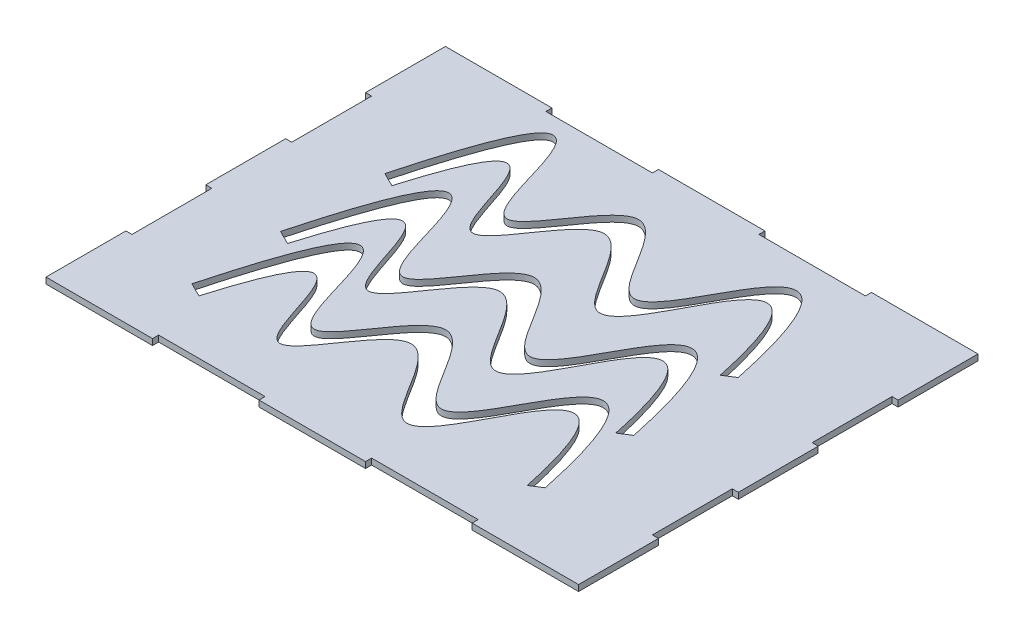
ISO-10303-21;
HEADER;
FILE_DESCRIPTION(('STEP AP214'),'2;1');
FILE_NAME('part.step','',(''),(''),'','','');
FILE_SCHEMA(('AUTOMOTIVE_DESIGN { 1 0 10303 214 1 1 1 1 }'));
ENDSEC;
DATA;
#1=APPLICATION_CONTEXT('core data for automotive mechanical design processes');
#2=APPLICATION_PROTOCOL_DEFINITION('international standard','automotive_design',2000,#1);
#3=PRODUCT_CONTEXT('',#1,'mechanical');
#4=PRODUCT('Part','Part','',(#3));
#5=PRODUCT_RELATED_PRODUCT_CATEGORY('part','',(#4));
#6=PRODUCT_DEFINITION_FORMATION('','',#4);
#7=PRODUCT_DEFINITION_CONTEXT('part definition',#1,'design');
#8=PRODUCT_DEFINITION('design','',#6,#7);
#9=PRODUCT_DEFINITION_SHAPE('','',#8);
#10=(LENGTH_UNIT() NAMED_UNIT(*) SI_UNIT(.MILLI.,.METRE.));
#11=(NAMED_UNIT(*) PLANE_ANGLE_UNIT() SI_UNIT($,.RADIAN.));
#12=(NAMED_UNIT(*) SI_UNIT($,.STERADIAN.) SOLID_ANGLE_UNIT());
#13=UNCERTAINTY_MEASURE_WITH_UNIT(LENGTH_MEASURE(1.E-05),#10,'distance_accuracy_value','');
#14=(GEOMETRIC_REPRESENTATION_CONTEXT(3) GLOBAL_UNCERTAINTY_ASSIGNED_CONTEXT((#13)) GLOBAL_UNIT_ASSIGNED_CONTEXT((#10,
#11,#12)) REPRESENTATION_CONTEXT('',''));
#15=CARTESIAN_POINT('',(0.,0.,0.));
#16=DIRECTION('',(0.,0.,1.));
#17=DIRECTION('',(1.,0.,0.));
#18=AXIS2_PLACEMENT_3D('',#15,#16,#17);
#19=CARTESIAN_POINT('',(60.0000000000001,2.28,75.));
#20=DIRECTION('',(0.,0.,-1.));
#21=DIRECTION('',(-1.,0.,0.));
#22=AXIS2_PLACEMENT_3D('',#19,#20,#21);
#23=PLANE('',#22);
#24=DIRECTION('',(1.,0.,0.));
#25=VECTOR('',#24,1.);
#26=CARTESIAN_POINT('',(60.0000000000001,0.,75.));
#27=LINE('',#26,#25);
#28=CARTESIAN_POINT('',(60.0000000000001,0.,75.));
#29=VERTEX_POINT('',#28);
#30=CARTESIAN_POINT('',(100.,0.,75.));
#31=VERTEX_POINT('',#30);
#32=EDGE_CURVE('E600',#29,#31,#27,.T.);
#33=ORIENTED_EDGE('',*,*,#32,.T.);
#34=DIRECTION('',(0.,-1.,0.));
#35=VECTOR('',#34,1.);
#36=CARTESIAN_POINT('',(100.,2.28,75.));
#37=LINE('',#36,#35);
#38=CARTESIAN_POINT('',(100.,2.28,75.));
#39=VERTEX_POINT('',#38);
#40=EDGE_CURVE('E594',#39,#31,#37,.T.);
#41=ORIENTED_EDGE('',*,*,#40,.F.);
#42=DIRECTION('',(1.,0.,0.));
#43=VECTOR('',#42,1.);
#44=CARTESIAN_POINT('',(60.0000000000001,2.28,75.));
#45=LINE('',#44,#43);
#46=CARTESIAN_POINT('',(60.0000000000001,2.28,75.));
#47=VERTEX_POINT('',#46);
#48=EDGE_CURVE('E678',#47,#39,#45,.T.);
#49=ORIENTED_EDGE('',*,*,#48,.F.);
#50=DIRECTION('',(0.,-1.,0.));
#51=VECTOR('',#50,1.);
#52=CARTESIAN_POINT('',(60.0000000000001,2.28,75.));
#53=LINE('',#52,#51);
#54=EDGE_CURVE('E679',#47,#29,#53,.T.);
#55=ORIENTED_EDGE('',*,*,#54,.T.);
#56=EDGE_LOOP('',(#33,#41,#49,#55));
#57=FACE_BOUND('',#56,.T.);
#58=ADVANCED_FACE('F37',(#57),#23,.F.);
#59=CARTESIAN_POINT('',(100.,2.28,45.));
#60=DIRECTION('',(-1.,0.,0.));
#61=DIRECTION('',(0.,0.,1.));
#62=AXIS2_PLACEMENT_3D('',#59,#60,#61);
#63=PLANE('',#62);
#64=DIRECTION('',(0.,0.,-1.));
#65=VECTOR('',#64,1.);
#66=CARTESIAN_POINT('',(100.,0.,45.));
#67=LINE('',#66,#65);
#68=CARTESIAN_POINT('',(100.,0.,45.));
#69=VERTEX_POINT('',#68);
#70=EDGE_CURVE('E589',#31,#69,#67,.T.);
#71=ORIENTED_EDGE('',*,*,#70,.T.);
#72=DIRECTION('',(0.,-1.,0.));
#73=VECTOR('',#72,1.);
#74=CARTESIAN_POINT('',(100.,2.28,45.));
#75=LINE('',#74,#73);
#76=CARTESIAN_POINT('',(100.,2.28,45.));
#77=VERTEX_POINT('',#76);
#78=EDGE_CURVE('E591',#77,#69,#75,.T.);
#79=ORIENTED_EDGE('',*,*,#78,.F.);
#80=DIRECTION('',(0.,0.,-1.));
#81=VECTOR('',#80,1.);
#82=CARTESIAN_POINT('',(100.,2.28,45.));
#83=LINE('',#82,#81);
#84=EDGE_CURVE('E898',#39,#77,#83,.T.);
#85=ORIENTED_EDGE('',*,*,#84,.F.);
#86=ORIENTED_EDGE('',*,*,#40,.T.);
#87=EDGE_LOOP('',(#71,#79,#85,#86));
#88=FACE_BOUND('',#87,.T.);
#89=ADVANCED_FACE('F579',(#88),#63,.F.);
#90=CARTESIAN_POINT('',(97.72,2.28,45.));
#91=DIRECTION('',(0.,0.,1.));
#92=DIRECTION('',(1.,0.,0.));
#93=AXIS2_PLACEMENT_3D('',#90,#91,#92);
#94=PLANE('',#93);
#95=DIRECTION('',(-1.,0.,0.));
#96=VECTOR('',#95,1.);
#97=CARTESIAN_POINT('',(97.72,0.,45.));
#98=LINE('',#97,#96);
#99=CARTESIAN_POINT('',(97.72,0.,45.));
#100=VERTEX_POINT('',#99);
#101=EDGE_CURVE('E599',#69,#100,#98,.T.);
#102=ORIENTED_EDGE('',*,*,#101,.T.);
#103=DIRECTION('',(0.,-1.,0.));
#104=VECTOR('',#103,1.);
#105=CARTESIAN_POINT('',(97.72,2.28,45.));
#106=LINE('',#105,#104);
#107=CARTESIAN_POINT('',(97.72,2.28,45.));
#108=VERTEX_POINT('',#107);
#109=EDGE_CURVE('E605',#108,#100,#106,.T.);
#110=ORIENTED_EDGE('',*,*,#109,.F.);
#111=DIRECTION('',(-1.,0.,0.));
#112=VECTOR('',#111,1.);
#113=CARTESIAN_POINT('',(97.72,2.28,45.));
#114=LINE('',#113,#112);
#115=EDGE_CURVE('E604',#77,#108,#114,.T.);
#116=ORIENTED_EDGE('',*,*,#115,.F.);
#117=ORIENTED_EDGE('',*,*,#78,.T.);
#118=EDGE_LOOP('',(#102,#110,#116,#117));
#119=FACE_BOUND('',#118,.T.);
#120=ADVANCED_FACE('F576',(#119),#94,.F.);
#121=CARTESIAN_POINT('',(97.72,2.28,15.));
#122=DIRECTION('',(-1.,0.,0.));
#123=DIRECTION('',(0.,0.,1.));
#124=AXIS2_PLACEMENT_3D('',#121,#122,#123);
#125=PLANE('',#124);
#126=DIRECTION('',(0.,0.,-1.));
#127=VECTOR('',#126,1.);
#128=CARTESIAN_POINT('',(97.72,0.,15.));
#129=LINE('',#128,#127);
#130=CARTESIAN_POINT('',(97.72,0.,15.));
#131=VERTEX_POINT('',#130);
#132=EDGE_CURVE('E609',#100,#131,#129,.T.);
#133=ORIENTED_EDGE('',*,*,#132,.T.);
#134=DIRECTION('',(0.,-1.,0.));
#135=VECTOR('',#134,1.);
#136=CARTESIAN_POINT('',(97.72,2.28,15.));
#137=LINE('',#136,#135);
#138=CARTESIAN_POINT('',(97.72,2.28,15.));
#139=VERTEX_POINT('',#138);
#140=EDGE_CURVE('E776',#139,#131,#137,.T.);
#141=ORIENTED_EDGE('',*,*,#140,.F.);
#142=DIRECTION('',(0.,0.,-1.));
#143=VECTOR('',#142,1.);
#144=CARTESIAN_POINT('',(97.72,2.28,15.));
#145=LINE('',#144,#143);
#146=EDGE_CURVE('E901',#108,#139,#145,.T.);
#147=ORIENTED_EDGE('',*,*,#146,.F.);
#148=ORIENTED_EDGE('',*,*,#109,.T.);
#149=EDGE_LOOP('',(#133,#141,#147,#148));
#150=FACE_BOUND('',#149,.T.);
#151=ADVANCED_FACE('F572',(#150),#125,.F.);
#152=CARTESIAN_POINT('',(100.,2.28,15.));
#153=DIRECTION('',(0.,0.,-1.));
#154=DIRECTION('',(-1.,0.,0.));
#155=AXIS2_PLACEMENT_3D('',#152,#153,#154);
#156=PLANE('',#155);
#157=DIRECTION('',(1.,0.,0.));
#158=VECTOR('',#157,1.);
#159=CARTESIAN_POINT('',(100.,0.,15.));
#160=LINE('',#159,#158);
#161=CARTESIAN_POINT('',(100.,0.,15.));
#162=VERTEX_POINT('',#161);
#163=EDGE_CURVE('E611',#131,#162,#160,.T.);
#164=ORIENTED_EDGE('',*,*,#163,.T.);
#165=DIRECTION('',(0.,-1.,0.));
#166=VECTOR('',#165,1.);
#167=CARTESIAN_POINT('',(100.,2.28,15.));
#168=LINE('',#167,#166);
#169=CARTESIAN_POINT('',(100.,2.28,15.));
#170=VERTEX_POINT('',#169);
#171=EDGE_CURVE('E773',#170,#162,#168,.T.);
#172=ORIENTED_EDGE('',*,*,#171,.F.);
#173=DIRECTION('',(1.,0.,0.));
#174=VECTOR('',#173,1.);
#175=CARTESIAN_POINT('',(100.,2.28,15.));
#176=LINE('',#175,#174);
#177=EDGE_CURVE('E903',#139,#170,#176,.T.);
#178=ORIENTED_EDGE('',*,*,#177,.F.);
#179=ORIENTED_EDGE('',*,*,#140,.T.);
#180=EDGE_LOOP('',(#164,#172,#178,#179));
#181=FACE_BOUND('',#180,.T.);
#182=ADVANCED_FACE('F568',(#181),#156,.F.);
#183=CARTESIAN_POINT('',(100.,2.28,-15.));
#184=DIRECTION('',(-1.,0.,0.));
#185=DIRECTION('',(0.,0.,1.));
#186=AXIS2_PLACEMENT_3D('',#183,#184,#185);
#187=PLANE('',#186);
#188=DIRECTION('',(0.,0.,-1.));
#189=VECTOR('',#188,1.);
#190=CARTESIAN_POINT('',(100.,0.,-15.));
#191=LINE('',#190,#189);
#192=CARTESIAN_POINT('',(100.,0.,-15.));
#193=VERTEX_POINT('',#192);
#194=EDGE_CURVE('E616',#162,#193,#191,.T.);
#195=ORIENTED_EDGE('',*,*,#194,.T.);
#196=DIRECTION('',(0.,-1.,0.));
#197=VECTOR('',#196,1.);
#198=CARTESIAN_POINT('',(100.,2.28,-15.));
#199=LINE('',#198,#197);
#200=CARTESIAN_POINT('',(100.,2.28,-15.));
#201=VERTEX_POINT('',#200);
#202=EDGE_CURVE('E770',#201,#193,#199,.T.);
#203=ORIENTED_EDGE('',*,*,#202,.F.);
#204=DIRECTION('',(0.,0.,-1.));
#205=VECTOR('',#204,1.);
#206=CARTESIAN_POINT('',(100.,2.28,-15.));
#207=LINE('',#206,#205);
#208=EDGE_CURVE('E905',#170,#201,#207,.T.);
#209=ORIENTED_EDGE('',*,*,#208,.F.);
#210=ORIENTED_EDGE('',*,*,#171,.T.);
#211=EDGE_LOOP('',(#195,#203,#209,#210));
#212=FACE_BOUND('',#211,.T.);
#213=ADVANCED_FACE('F564',(#212),#187,.F.);
#214=CARTESIAN_POINT('',(97.72,2.28,-15.));
#215=DIRECTION('',(0.,0.,1.));
#216=DIRECTION('',(1.,0.,0.));
#217=AXIS2_PLACEMENT_3D('',#214,#215,#216);
#218=PLANE('',#217);
#219=DIRECTION('',(-1.,0.,0.));
#220=VECTOR('',#219,1.);
#221=CARTESIAN_POINT('',(97.72,0.,-15.));
#222=LINE('',#221,#220);
#223=CARTESIAN_POINT('',(97.72,0.,-15.));
#224=VERTEX_POINT('',#223);
#225=EDGE_CURVE('E618',#193,#224,#222,.T.);
#226=ORIENTED_EDGE('',*,*,#225,.T.);
#227=DIRECTION('',(0.,-1.,0.));
#228=VECTOR('',#227,1.);
#229=CARTESIAN_POINT('',(97.72,2.28,-15.));
#230=LINE('',#229,#228);
#231=CARTESIAN_POINT('',(97.72,2.28,-15.));
#232=VERTEX_POINT('',#231);
#233=EDGE_CURVE('E767',#232,#224,#230,.T.);
#234=ORIENTED_EDGE('',*,*,#233,.F.);
#235=DIRECTION('',(-1.,0.,0.));
#236=VECTOR('',#235,1.);
#237=CARTESIAN_POINT('',(97.72,2.28,-15.));
#238=LINE('',#237,#236);
#239=EDGE_CURVE('E907',#201,#232,#238,.T.);
#240=ORIENTED_EDGE('',*,*,#239,.F.);
#241=ORIENTED_EDGE('',*,*,#202,.T.);
#242=EDGE_LOOP('',(#226,#234,#240,#241));
#243=FACE_BOUND('',#242,.T.);
#244=ADVANCED_FACE('F560',(#243),#218,.F.);
#245=CARTESIAN_POINT('',(97.72,2.28,-45.));
#246=DIRECTION('',(-1.,0.,0.));
#247=DIRECTION('',(0.,0.,1.));
#248=AXIS2_PLACEMENT_3D('',#245,#246,#247);
#249=PLANE('',#248);
#250=DIRECTION('',(0.,0.,-1.));
#251=VECTOR('',#250,1.);
#252=CARTESIAN_POINT('',(97.72,0.,-45.));
#253=LINE('',#252,#251);
#254=CARTESIAN_POINT('',(97.72,0.,-45.));
#255=VERTEX_POINT('',#254);
#256=EDGE_CURVE('E620',#224,#255,#253,.T.);
#257=ORIENTED_EDGE('',*,*,#256,.T.);
#258=DIRECTION('',(0.,-1.,0.));
#259=VECTOR('',#258,1.);
#260=CARTESIAN_POINT('',(97.72,2.28,-45.));
#261=LINE('',#260,#259);
#262=CARTESIAN_POINT('',(97.72,2.28,-45.));
#263=VERTEX_POINT('',#262);
#264=EDGE_CURVE('E764',#263,#255,#261,.T.);
#265=ORIENTED_EDGE('',*,*,#264,.F.);
#266=DIRECTION('',(0.,0.,-1.));
#267=VECTOR('',#266,1.);
#268=CARTESIAN_POINT('',(97.72,2.28,-45.));
#269=LINE('',#268,#267);
#270=EDGE_CURVE('E909',#232,#263,#269,.T.);
#271=ORIENTED_EDGE('',*,*,#270,.F.);
#272=ORIENTED_EDGE('',*,*,#233,.T.);
#273=EDGE_LOOP('',(#257,#265,#271,#272));
#274=FACE_BOUND('',#273,.T.);
#275=ADVANCED_FACE('F556',(#274),#249,.F.);
#276=CARTESIAN_POINT('',(100.,2.28,-45.));
#277=DIRECTION('',(0.,0.,-1.));
#278=DIRECTION('',(-1.,0.,0.));
#279=AXIS2_PLACEMENT_3D('',#276,#277,#278);
#280=PLANE('',#279);
#281=DIRECTION('',(1.,0.,0.));
#282=VECTOR('',#281,1.);
#283=CARTESIAN_POINT('',(100.,0.,-45.));
#284=LINE('',#283,#282);
#285=CARTESIAN_POINT('',(100.,0.,-45.));
#286=VERTEX_POINT('',#285);
#287=EDGE_CURVE('E622',#255,#286,#284,.T.);
#288=ORIENTED_EDGE('',*,*,#287,.T.);
#289=DIRECTION('',(0.,-1.,0.));
#290=VECTOR('',#289,1.);
#291=CARTESIAN_POINT('',(100.,2.28,-45.));
#292=LINE('',#291,#290);
#293=CARTESIAN_POINT('',(100.,2.28,-45.));
#294=VERTEX_POINT('',#293);
#295=EDGE_CURVE('E761',#294,#286,#292,.T.);
#296=ORIENTED_EDGE('',*,*,#295,.F.);
#297=DIRECTION('',(1.,0.,0.));
#298=VECTOR('',#297,1.);
#299=CARTESIAN_POINT('',(100.,2.28,-45.));
#300=LINE('',#299,#298);
#301=EDGE_CURVE('E911',#263,#294,#300,.T.);
#302=ORIENTED_EDGE('',*,*,#301,.F.);
#303=ORIENTED_EDGE('',*,*,#264,.T.);
#304=EDGE_LOOP('',(#288,#296,#302,#303));
#305=FACE_BOUND('',#304,.T.);
#306=ADVANCED_FACE('F552',(#305),#280,.F.);
#307=CARTESIAN_POINT('',(100.,2.28,-45.));
#308=DIRECTION('',(-1.,0.,0.));
#309=DIRECTION('',(0.,0.,1.));
#310=AXIS2_PLACEMENT_3D('',#307,#308,#309);
#311=PLANE('',#310);
#312=DIRECTION('',(0.,0.,-1.));
#313=VECTOR('',#312,1.);
#314=CARTESIAN_POINT('',(100.,0.,-45.));
#315=LINE('',#314,#313);
#316=CARTESIAN_POINT('',(100.,0.,-75.));
#317=VERTEX_POINT('',#316);
#318=EDGE_CURVE('E624',#286,#317,#315,.T.);
#319=ORIENTED_EDGE('',*,*,#318,.T.);
#320=DIRECTION('',(0.,-1.,0.));
#321=VECTOR('',#320,1.);
#322=CARTESIAN_POINT('',(100.,2.28,-75.));
#323=LINE('',#322,#321);
#324=CARTESIAN_POINT('',(100.,2.28,-75.));
#325=VERTEX_POINT('',#324);
#326=EDGE_CURVE('E758',#325,#317,#323,.T.);
#327=ORIENTED_EDGE('',*,*,#326,.F.);
#328=DIRECTION('',(0.,0.,-1.));
#329=VECTOR('',#328,1.);
#330=CARTESIAN_POINT('',(100.,2.28,-45.));
#331=LINE('',#330,#329);
#332=EDGE_CURVE('E913',#294,#325,#331,.T.);
#333=ORIENTED_EDGE('',*,*,#332,.F.);
#334=ORIENTED_EDGE('',*,*,#295,.T.);
#335=EDGE_LOOP('',(#319,#327,#333,#334));
#336=FACE_BOUND('',#335,.T.);
#337=ADVANCED_FACE('F548',(#336),#311,.F.);
#338=CARTESIAN_POINT('',(60.,2.28,-75.));
#339=DIRECTION('',(0.,0.,1.));
#340=DIRECTION('',(1.,0.,0.));
#341=AXIS2_PLACEMENT_3D('',#338,#339,#340);
#342=PLANE('',#341);
#343=DIRECTION('',(-1.,0.,0.));
#344=VECTOR('',#343,1.);
#345=CARTESIAN_POINT('',(60.,0.,-75.));
#346=LINE('',#345,#344);
#347=CARTESIAN_POINT('',(60.,0.,-75.));
#348=VERTEX_POINT('',#347);
#349=EDGE_CURVE('E626',#317,#348,#346,.T.);
#350=ORIENTED_EDGE('',*,*,#349,.T.);
#351=DIRECTION('',(0.,-1.,0.));
#352=VECTOR('',#351,1.);
#353=CARTESIAN_POINT('',(60.,2.28,-75.));
#354=LINE('',#353,#352);
#355=CARTESIAN_POINT('',(60.,2.28,-75.));
#356=VERTEX_POINT('',#355);
#357=EDGE_CURVE('E755',#356,#348,#354,.T.);
#358=ORIENTED_EDGE('',*,*,#357,.F.);
#359=DIRECTION('',(-1.,0.,0.));
#360=VECTOR('',#359,1.);
#361=CARTESIAN_POINT('',(60.,2.28,-75.));
#362=LINE('',#361,#360);
#363=EDGE_CURVE('E915',#325,#356,#362,.T.);
#364=ORIENTED_EDGE('',*,*,#363,.F.);
#365=ORIENTED_EDGE('',*,*,#326,.T.);
#366=EDGE_LOOP('',(#350,#358,#364,#365));
#367=FACE_BOUND('',#366,.T.);
#368=ADVANCED_FACE('F544',(#367),#342,.F.);
#369=CARTESIAN_POINT('',(60.,2.28,-72.72));
#370=DIRECTION('',(1.,0.,0.));
#371=DIRECTION('',(0.,0.,-1.));
#372=AXIS2_PLACEMENT_3D('',#369,#370,#371);
#373=PLANE('',#372);
#374=DIRECTION('',(0.,0.,1.));
#375=VECTOR('',#374,1.);
#376=CARTESIAN_POINT('',(60.,0.,-72.72));
#377=LINE('',#376,#375);
#378=CARTESIAN_POINT('',(60.,0.,-72.72));
#379=VERTEX_POINT('',#378);
#380=EDGE_CURVE('E628',#348,#379,#377,.T.);
#381=ORIENTED_EDGE('',*,*,#380,.T.);
#382=DIRECTION('',(0.,-1.,0.));
#383=VECTOR('',#382,1.);
#384=CARTESIAN_POINT('',(60.,2.28,-72.72));
#385=LINE('',#384,#383);
#386=CARTESIAN_POINT('',(60.,2.28,-72.72));
#387=VERTEX_POINT('',#386);
#388=EDGE_CURVE('E752',#387,#379,#385,.T.);
#389=ORIENTED_EDGE('',*,*,#388,.F.);
#390=DIRECTION('',(0.,0.,1.));
#391=VECTOR('',#390,1.);
#392=CARTESIAN_POINT('',(60.,2.28,-72.72));
#393=LINE('',#392,#391);
#394=EDGE_CURVE('E917',#356,#387,#393,.T.);
#395=ORIENTED_EDGE('',*,*,#394,.F.);
#396=ORIENTED_EDGE('',*,*,#357,.T.);
#397=EDGE_LOOP('',(#381,#389,#395,#396));
#398=FACE_BOUND('',#397,.T.);
#399=ADVANCED_FACE('F540',(#398),#373,.F.);
#400=CARTESIAN_POINT('',(20.,2.28,-72.72));
#401=DIRECTION('',(0.,0.,1.));
#402=DIRECTION('',(1.,0.,0.));
#403=AXIS2_PLACEMENT_3D('',#400,#401,#402);
#404=PLANE('',#403);
#405=DIRECTION('',(-1.,0.,0.));
#406=VECTOR('',#405,1.);
#407=CARTESIAN_POINT('',(20.,0.,-72.72));
#408=LINE('',#407,#406);
#409=CARTESIAN_POINT('',(20.,0.,-72.72));
#410=VERTEX_POINT('',#409);
#411=EDGE_CURVE('E630',#379,#410,#408,.T.);
#412=ORIENTED_EDGE('',*,*,#411,.T.);
#413=DIRECTION('',(0.,-1.,0.));
#414=VECTOR('',#413,1.);
#415=CARTESIAN_POINT('',(20.,2.28,-72.72));
#416=LINE('',#415,#414);
#417=CARTESIAN_POINT('',(20.,2.28,-72.72));
#418=VERTEX_POINT('',#417);
#419=EDGE_CURVE('E749',#418,#410,#416,.T.);
#420=ORIENTED_EDGE('',*,*,#419,.F.);
#421=DIRECTION('',(-1.,0.,0.));
#422=VECTOR('',#421,1.);
#423=CARTESIAN_POINT('',(20.,2.28,-72.72));
#424=LINE('',#423,#422);
#425=EDGE_CURVE('E919',#387,#418,#424,.T.);
#426=ORIENTED_EDGE('',*,*,#425,.F.);
#427=ORIENTED_EDGE('',*,*,#388,.T.);
#428=EDGE_LOOP('',(#412,#420,#426,#427));
#429=FACE_BOUND('',#428,.T.);
#430=ADVANCED_FACE('F536',(#429),#404,.F.);
#431=CARTESIAN_POINT('',(20.,2.28,-75.));
#432=DIRECTION('',(-1.,0.,0.));
#433=DIRECTION('',(0.,0.,1.));
#434=AXIS2_PLACEMENT_3D('',#431,#432,#433);
#435=PLANE('',#434);
#436=DIRECTION('',(0.,0.,-1.));
#437=VECTOR('',#436,1.);
#438=CARTESIAN_POINT('',(20.,0.,-75.));
#439=LINE('',#438,#437);
#440=CARTESIAN_POINT('',(20.,0.,-75.));
#441=VERTEX_POINT('',#440);
#442=EDGE_CURVE('E632',#410,#441,#439,.T.);
#443=ORIENTED_EDGE('',*,*,#442,.T.);
#444=DIRECTION('',(0.,-1.,0.));
#445=VECTOR('',#444,1.);
#446=CARTESIAN_POINT('',(20.,2.28,-75.));
#447=LINE('',#446,#445);
#448=CARTESIAN_POINT('',(20.,2.28,-75.));
#449=VERTEX_POINT('',#448);
#450=EDGE_CURVE('E746',#449,#441,#447,.T.);
#451=ORIENTED_EDGE('',*,*,#450,.F.);
#452=DIRECTION('',(0.,0.,-1.));
#453=VECTOR('',#452,1.);
#454=CARTESIAN_POINT('',(20.,2.28,-75.));
#455=LINE('',#454,#453);
#456=EDGE_CURVE('E921',#418,#449,#455,.T.);
#457=ORIENTED_EDGE('',*,*,#456,.F.);
#458=ORIENTED_EDGE('',*,*,#419,.T.);
#459=EDGE_LOOP('',(#443,#451,#457,#458));
#460=FACE_BOUND('',#459,.T.);
#461=ADVANCED_FACE('F532',(#460),#435,.F.);
#462=CARTESIAN_POINT('',(-20.,2.28,-75.));
#463=DIRECTION('',(0.,0.,1.));
#464=DIRECTION('',(1.,0.,0.));
#465=AXIS2_PLACEMENT_3D('',#462,#463,#464);
#466=PLANE('',#465);
#467=DIRECTION('',(-1.,0.,0.));
#468=VECTOR('',#467,1.);
#469=CARTESIAN_POINT('',(-20.,0.,-75.));
#470=LINE('',#469,#468);
#471=CARTESIAN_POINT('',(-20.,0.,-75.));
#472=VERTEX_POINT('',#471);
#473=EDGE_CURVE('E634',#441,#472,#470,.T.);
#474=ORIENTED_EDGE('',*,*,#473,.T.);
#475=DIRECTION('',(0.,-1.,0.));
#476=VECTOR('',#475,1.);
#477=CARTESIAN_POINT('',(-20.,2.28,-75.));
#478=LINE('',#477,#476);
#479=CARTESIAN_POINT('',(-20.,2.28,-75.));
#480=VERTEX_POINT('',#479);
#481=EDGE_CURVE('E743',#480,#472,#478,.T.);
#482=ORIENTED_EDGE('',*,*,#481,.F.);
#483=DIRECTION('',(-1.,0.,0.));
#484=VECTOR('',#483,1.);
#485=CARTESIAN_POINT('',(-20.,2.28,-75.));
#486=LINE('',#485,#484);
#487=EDGE_CURVE('E923',#449,#480,#486,.T.);
#488=ORIENTED_EDGE('',*,*,#487,.F.);
#489=ORIENTED_EDGE('',*,*,#450,.T.);
#490=EDGE_LOOP('',(#474,#482,#488,#489));
#491=FACE_BOUND('',#490,.T.);
#492=ADVANCED_FACE('F528',(#491),#466,.F.);
#493=CARTESIAN_POINT('',(-20.,2.28,-72.72));
#494=DIRECTION('',(1.,0.,0.));
#495=DIRECTION('',(0.,0.,-1.));
#496=AXIS2_PLACEMENT_3D('',#493,#494,#495);
#497=PLANE('',#496);
#498=DIRECTION('',(0.,0.,1.));
#499=VECTOR('',#498,1.);
#500=CARTESIAN_POINT('',(-20.,0.,-72.72));
#501=LINE('',#500,#499);
#502=CARTESIAN_POINT('',(-20.,0.,-72.72));
#503=VERTEX_POINT('',#502);
#504=EDGE_CURVE('E636',#472,#503,#501,.T.);
#505=ORIENTED_EDGE('',*,*,#504,.T.);
#506=DIRECTION('',(0.,-1.,0.));
#507=VECTOR('',#506,1.);
#508=CARTESIAN_POINT('',(-20.,2.28,-72.72));
#509=LINE('',#508,#507);
#510=CARTESIAN_POINT('',(-20.,2.28,-72.72));
#511=VERTEX_POINT('',#510);
#512=EDGE_CURVE('E740',#511,#503,#509,.T.);
#513=ORIENTED_EDGE('',*,*,#512,.F.);
#514=DIRECTION('',(0.,0.,1.));
#515=VECTOR('',#514,1.);
#516=CARTESIAN_POINT('',(-20.,2.28,-72.72));
#517=LINE('',#516,#515);
#518=EDGE_CURVE('E925',#480,#511,#517,.T.);
#519=ORIENTED_EDGE('',*,*,#518,.F.);
#520=ORIENTED_EDGE('',*,*,#481,.T.);
#521=EDGE_LOOP('',(#505,#513,#519,#520));
#522=FACE_BOUND('',#521,.T.);
#523=ADVANCED_FACE('F524',(#522),#497,.F.);
#524=CARTESIAN_POINT('',(-60.,2.28,-72.72));
#525=DIRECTION('',(0.,0.,1.));
#526=DIRECTION('',(1.,0.,0.));
#527=AXIS2_PLACEMENT_3D('',#524,#525,#526);
#528=PLANE('',#527);
#529=DIRECTION('',(-1.,0.,0.));
#530=VECTOR('',#529,1.);
#531=CARTESIAN_POINT('',(-60.,0.,-72.72));
#532=LINE('',#531,#530);
#533=CARTESIAN_POINT('',(-60.,0.,-72.72));
#534=VERTEX_POINT('',#533);
#535=EDGE_CURVE('E638',#503,#534,#532,.T.);
#536=ORIENTED_EDGE('',*,*,#535,.T.);
#537=DIRECTION('',(0.,-1.,0.));
#538=VECTOR('',#537,1.);
#539=CARTESIAN_POINT('',(-60.,2.28,-72.72));
#540=LINE('',#539,#538);
#541=CARTESIAN_POINT('',(-60.,2.28,-72.72));
#542=VERTEX_POINT('',#541);
#543=EDGE_CURVE('E737',#542,#534,#540,.T.);
#544=ORIENTED_EDGE('',*,*,#543,.F.);
#545=DIRECTION('',(-1.,0.,0.));
#546=VECTOR('',#545,1.);
#547=CARTESIAN_POINT('',(-60.,2.28,-72.72));
#548=LINE('',#547,#546);
#549=EDGE_CURVE('E927',#511,#542,#548,.T.);
#550=ORIENTED_EDGE('',*,*,#549,.F.);
#551=ORIENTED_EDGE('',*,*,#512,.T.);
#552=EDGE_LOOP('',(#536,#544,#550,#551));
#553=FACE_BOUND('',#552,.T.);
#554=ADVANCED_FACE('F520',(#553),#528,.F.);
#555=CARTESIAN_POINT('',(-60.,2.28,-75.));
#556=DIRECTION('',(-1.,0.,0.));
#557=DIRECTION('',(0.,0.,1.));
#558=AXIS2_PLACEMENT_3D('',#555,#556,#557);
#559=PLANE('',#558);
#560=DIRECTION('',(0.,0.,-1.));
#561=VECTOR('',#560,1.);
#562=CARTESIAN_POINT('',(-60.,0.,-75.));
#563=LINE('',#562,#561);
#564=CARTESIAN_POINT('',(-60.,0.,-75.));
#565=VERTEX_POINT('',#564);
#566=EDGE_CURVE('E640',#534,#565,#563,.T.);
#567=ORIENTED_EDGE('',*,*,#566,.T.);
#568=DIRECTION('',(0.,-1.,0.));
#569=VECTOR('',#568,1.);
#570=CARTESIAN_POINT('',(-60.,2.28,-75.));
#571=LINE('',#570,#569);
#572=CARTESIAN_POINT('',(-60.,2.28,-75.));
#573=VERTEX_POINT('',#572);
#574=EDGE_CURVE('E734',#573,#565,#571,.T.);
#575=ORIENTED_EDGE('',*,*,#574,.F.);
#576=DIRECTION('',(0.,0.,-1.));
#577=VECTOR('',#576,1.);
#578=CARTESIAN_POINT('',(-60.,2.28,-75.));
#579=LINE('',#578,#577);
#580=EDGE_CURVE('E929',#542,#573,#579,.T.);
#581=ORIENTED_EDGE('',*,*,#580,.F.);
#582=ORIENTED_EDGE('',*,*,#543,.T.);
#583=EDGE_LOOP('',(#567,#575,#581,#582));
#584=FACE_BOUND('',#583,.T.);
#585=ADVANCED_FACE('F516',(#584),#559,.F.);
#586=CARTESIAN_POINT('',(-100.,2.28,-75.));
#587=DIRECTION('',(0.,0.,1.));
#588=DIRECTION('',(1.,0.,0.));
#589=AXIS2_PLACEMENT_3D('',#586,#587,#588);
#590=PLANE('',#589);
#591=DIRECTION('',(-1.,0.,0.));
#592=VECTOR('',#591,1.);
#593=CARTESIAN_POINT('',(-100.,0.,-75.));
#594=LINE('',#593,#592);
#595=CARTESIAN_POINT('',(-100.,0.,-75.));
#596=VERTEX_POINT('',#595);
#597=EDGE_CURVE('E642',#565,#596,#594,.T.);
#598=ORIENTED_EDGE('',*,*,#597,.T.);
#599=DIRECTION('',(0.,-1.,0.));
#600=VECTOR('',#599,1.);
#601=CARTESIAN_POINT('',(-100.,2.28,-75.));
#602=LINE('',#601,#600);
#603=CARTESIAN_POINT('',(-100.,2.28,-75.));
#604=VERTEX_POINT('',#603);
#605=EDGE_CURVE('E731',#604,#596,#602,.T.);
#606=ORIENTED_EDGE('',*,*,#605,.F.);
#607=DIRECTION('',(-1.,0.,0.));
#608=VECTOR('',#607,1.);
#609=CARTESIAN_POINT('',(-100.,2.28,-75.));
#610=LINE('',#609,#608);
#611=EDGE_CURVE('E931',#573,#604,#610,.T.);
#612=ORIENTED_EDGE('',*,*,#611,.F.);
#613=ORIENTED_EDGE('',*,*,#574,.T.);
#614=EDGE_LOOP('',(#598,#606,#612,#613));
#615=FACE_BOUND('',#614,.T.);
#616=ADVANCED_FACE('F512',(#615),#590,.F.);
#617=CARTESIAN_POINT('',(-100.,2.28,-45.));
#618=DIRECTION('',(1.,0.,0.));
#619=DIRECTION('',(0.,0.,-1.));
#620=AXIS2_PLACEMENT_3D('',#617,#618,#619);
#621=PLANE('',#620);
#622=DIRECTION('',(0.,0.,1.));
#623=VECTOR('',#622,1.);
#624=CARTESIAN_POINT('',(-100.,0.,-45.));
#625=LINE('',#624,#623);
#626=CARTESIAN_POINT('',(-100.,0.,-45.));
#627=VERTEX_POINT('',#626);
#628=EDGE_CURVE('E644',#596,#627,#625,.T.);
#629=ORIENTED_EDGE('',*,*,#628,.T.);
#630=DIRECTION('',(0.,-1.,0.));
#631=VECTOR('',#630,1.);
#632=CARTESIAN_POINT('',(-100.,2.28,-45.));
#633=LINE('',#632,#631);
#634=CARTESIAN_POINT('',(-100.,2.28,-45.));
#635=VERTEX_POINT('',#634);
#636=EDGE_CURVE('E728',#635,#627,#633,.T.);
#637=ORIENTED_EDGE('',*,*,#636,.F.);
#638=DIRECTION('',(0.,0.,1.));
#639=VECTOR('',#638,1.);
#640=CARTESIAN_POINT('',(-100.,2.28,-45.));
#641=LINE('',#640,#639);
#642=EDGE_CURVE('E933',#604,#635,#641,.T.);
#643=ORIENTED_EDGE('',*,*,#642,.F.);
#644=ORIENTED_EDGE('',*,*,#605,.T.);
#645=EDGE_LOOP('',(#629,#637,#643,#644));
#646=FACE_BOUND('',#645,.T.);
#647=ADVANCED_FACE('F508',(#646),#621,.F.);
#648=CARTESIAN_POINT('',(-97.72,2.28,-45.));
#649=DIRECTION('',(0.,0.,-1.));
#650=DIRECTION('',(-1.,0.,0.));
#651=AXIS2_PLACEMENT_3D('',#648,#649,#650);
#652=PLANE('',#651);
#653=DIRECTION('',(1.,0.,0.));
#654=VECTOR('',#653,1.);
#655=CARTESIAN_POINT('',(-97.72,0.,-45.));
#656=LINE('',#655,#654);
#657=CARTESIAN_POINT('',(-97.72,0.,-45.));
#658=VERTEX_POINT('',#657);
#659=EDGE_CURVE('E646',#627,#658,#656,.T.);
#660=ORIENTED_EDGE('',*,*,#659,.T.);
#661=DIRECTION('',(0.,-1.,0.));
#662=VECTOR('',#661,1.);
#663=CARTESIAN_POINT('',(-97.72,2.28,-45.));
#664=LINE('',#663,#662);
#665=CARTESIAN_POINT('',(-97.72,2.28,-45.));
#666=VERTEX_POINT('',#665);
#667=EDGE_CURVE('E725',#666,#658,#664,.T.);
#668=ORIENTED_EDGE('',*,*,#667,.F.);
#669=DIRECTION('',(1.,0.,0.));
#670=VECTOR('',#669,1.);
#671=CARTESIAN_POINT('',(-97.72,2.28,-45.));
#672=LINE('',#671,#670);
#673=EDGE_CURVE('E935',#635,#666,#672,.T.);
#674=ORIENTED_EDGE('',*,*,#673,.F.);
#675=ORIENTED_EDGE('',*,*,#636,.T.);
#676=EDGE_LOOP('',(#660,#668,#674,#675));
#677=FACE_BOUND('',#676,.T.);
#678=ADVANCED_FACE('F504',(#677),#652,.F.);
#679=CARTESIAN_POINT('',(-97.72,2.28,-15.));
#680=DIRECTION('',(1.,0.,0.));
#681=DIRECTION('',(0.,0.,-1.));
#682=AXIS2_PLACEMENT_3D('',#679,#680,#681);
#683=PLANE('',#682);
#684=DIRECTION('',(0.,0.,1.));
#685=VECTOR('',#684,1.);
#686=CARTESIAN_POINT('',(-97.72,0.,-15.));
#687=LINE('',#686,#685);
#688=CARTESIAN_POINT('',(-97.72,0.,-15.));
#689=VERTEX_POINT('',#688);
#690=EDGE_CURVE('E648',#658,#689,#687,.T.);
#691=ORIENTED_EDGE('',*,*,#690,.T.);
#692=DIRECTION('',(0.,-1.,0.));
#693=VECTOR('',#692,1.);
#694=CARTESIAN_POINT('',(-97.72,2.28,-15.));
#695=LINE('',#694,#693);
#696=CARTESIAN_POINT('',(-97.72,2.28,-15.));
#697=VERTEX_POINT('',#696);
#698=EDGE_CURVE('E722',#697,#689,#695,.T.);
#699=ORIENTED_EDGE('',*,*,#698,.F.);
#700=DIRECTION('',(0.,0.,1.));
#701=VECTOR('',#700,1.);
#702=CARTESIAN_POINT('',(-97.72,2.28,-15.));
#703=LINE('',#702,#701);
#704=EDGE_CURVE('E937',#666,#697,#703,.T.);
#705=ORIENTED_EDGE('',*,*,#704,.F.);
#706=ORIENTED_EDGE('',*,*,#667,.T.);
#707=EDGE_LOOP('',(#691,#699,#705,#706));
#708=FACE_BOUND('',#707,.T.);
#709=ADVANCED_FACE('F500',(#708),#683,.F.);
#710=CARTESIAN_POINT('',(-100.,2.28,-15.));
#711=DIRECTION('',(0.,0.,1.));
#712=DIRECTION('',(1.,0.,0.));
#713=AXIS2_PLACEMENT_3D('',#710,#711,#712);
#714=PLANE('',#713);
#715=DIRECTION('',(-1.,0.,0.));
#716=VECTOR('',#715,1.);
#717=CARTESIAN_POINT('',(-100.,0.,-15.));
#718=LINE('',#717,#716);
#719=CARTESIAN_POINT('',(-100.,0.,-15.));
#720=VERTEX_POINT('',#719);
#721=EDGE_CURVE('E650',#689,#720,#718,.T.);
#722=ORIENTED_EDGE('',*,*,#721,.T.);
#723=DIRECTION('',(0.,-1.,0.));
#724=VECTOR('',#723,1.);
#725=CARTESIAN_POINT('',(-100.,2.28,-15.));
#726=LINE('',#725,#724);
#727=CARTESIAN_POINT('',(-100.,2.28,-15.));
#728=VERTEX_POINT('',#727);
#729=EDGE_CURVE('E719',#728,#720,#726,.T.);
#730=ORIENTED_EDGE('',*,*,#729,.F.);
#731=DIRECTION('',(-1.,0.,0.));
#732=VECTOR('',#731,1.);
#733=CARTESIAN_POINT('',(-100.,2.28,-15.));
#734=LINE('',#733,#732);
#735=EDGE_CURVE('E939',#697,#728,#734,.T.);
#736=ORIENTED_EDGE('',*,*,#735,.F.);
#737=ORIENTED_EDGE('',*,*,#698,.T.);
#738=EDGE_LOOP('',(#722,#730,#736,#737));
#739=FACE_BOUND('',#738,.T.);
#740=ADVANCED_FACE('F496',(#739),#714,.F.);
#741=CARTESIAN_POINT('',(-100.,2.28,15.));
#742=DIRECTION('',(1.,0.,0.));
#743=DIRECTION('',(0.,0.,-1.));
#744=AXIS2_PLACEMENT_3D('',#741,#742,#743);
#745=PLANE('',#744);
#746=DIRECTION('',(0.,0.,1.));
#747=VECTOR('',#746,1.);
#748=CARTESIAN_POINT('',(-100.,0.,15.));
#749=LINE('',#748,#747);
#750=CARTESIAN_POINT('',(-100.,0.,15.));
#751=VERTEX_POINT('',#750);
#752=EDGE_CURVE('E652',#720,#751,#749,.T.);
#753=ORIENTED_EDGE('',*,*,#752,.T.);
#754=DIRECTION('',(0.,-1.,0.));
#755=VECTOR('',#754,1.);
#756=CARTESIAN_POINT('',(-100.,2.28,15.));
#757=LINE('',#756,#755);
#758=CARTESIAN_POINT('',(-100.,2.28,15.));
#759=VERTEX_POINT('',#758);
#760=EDGE_CURVE('E716',#759,#751,#757,.T.);
#761=ORIENTED_EDGE('',*,*,#760,.F.);
#762=DIRECTION('',(0.,0.,1.));
#763=VECTOR('',#762,1.);
#764=CARTESIAN_POINT('',(-100.,2.28,15.));
#765=LINE('',#764,#763);
#766=EDGE_CURVE('E941',#728,#759,#765,.T.);
#767=ORIENTED_EDGE('',*,*,#766,.F.);
#768=ORIENTED_EDGE('',*,*,#729,.T.);
#769=EDGE_LOOP('',(#753,#761,#767,#768));
#770=FACE_BOUND('',#769,.T.);
#771=ADVANCED_FACE('F492',(#770),#745,.F.);
#772=CARTESIAN_POINT('',(-97.72,2.28,15.));
#773=DIRECTION('',(0.,0.,-1.));
#774=DIRECTION('',(-1.,0.,0.));
#775=AXIS2_PLACEMENT_3D('',#772,#773,#774);
#776=PLANE('',#775);
#777=DIRECTION('',(1.,0.,0.));
#778=VECTOR('',#777,1.);
#779=CARTESIAN_POINT('',(-97.72,0.,15.));
#780=LINE('',#779,#778);
#781=CARTESIAN_POINT('',(-97.72,0.,15.));
#782=VERTEX_POINT('',#781);
#783=EDGE_CURVE('E654',#751,#782,#780,.T.);
#784=ORIENTED_EDGE('',*,*,#783,.T.);
#785=DIRECTION('',(0.,-1.,0.));
#786=VECTOR('',#785,1.);
#787=CARTESIAN_POINT('',(-97.72,2.28,15.));
#788=LINE('',#787,#786);
#789=CARTESIAN_POINT('',(-97.72,2.28,15.));
#790=VERTEX_POINT('',#789);
#791=EDGE_CURVE('E713',#790,#782,#788,.T.);
#792=ORIENTED_EDGE('',*,*,#791,.F.);
#793=DIRECTION('',(1.,0.,0.));
#794=VECTOR('',#793,1.);
#795=CARTESIAN_POINT('',(-97.72,2.28,15.));
#796=LINE('',#795,#794);
#797=EDGE_CURVE('E943',#759,#790,#796,.T.);
#798=ORIENTED_EDGE('',*,*,#797,.F.);
#799=ORIENTED_EDGE('',*,*,#760,.T.);
#800=EDGE_LOOP('',(#784,#792,#798,#799));
#801=FACE_BOUND('',#800,.T.);
#802=ADVANCED_FACE('F488',(#801),#776,.F.);
#803=CARTESIAN_POINT('',(-97.72,2.28,45.));
#804=DIRECTION('',(1.,0.,0.));
#805=DIRECTION('',(0.,0.,-1.));
#806=AXIS2_PLACEMENT_3D('',#803,#804,#805);
#807=PLANE('',#806);
#808=DIRECTION('',(0.,0.,1.));
#809=VECTOR('',#808,1.);
#810=CARTESIAN_POINT('',(-97.72,0.,45.));
#811=LINE('',#810,#809);
#812=CARTESIAN_POINT('',(-97.72,0.,45.));
#813=VERTEX_POINT('',#812);
#814=EDGE_CURVE('E656',#782,#813,#811,.T.);
#815=ORIENTED_EDGE('',*,*,#814,.T.);
#816=DIRECTION('',(0.,-1.,0.));
#817=VECTOR('',#816,1.);
#818=CARTESIAN_POINT('',(-97.72,2.28,45.));
#819=LINE('',#818,#817);
#820=CARTESIAN_POINT('',(-97.72,2.28,45.));
#821=VERTEX_POINT('',#820);
#822=EDGE_CURVE('E710',#821,#813,#819,.T.);
#823=ORIENTED_EDGE('',*,*,#822,.F.);
#824=DIRECTION('',(0.,0.,1.));
#825=VECTOR('',#824,1.);
#826=CARTESIAN_POINT('',(-97.72,2.28,45.));
#827=LINE('',#826,#825);
#828=EDGE_CURVE('E945',#790,#821,#827,.T.);
#829=ORIENTED_EDGE('',*,*,#828,.F.);
#830=ORIENTED_EDGE('',*,*,#791,.T.);
#831=EDGE_LOOP('',(#815,#823,#829,#830));
#832=FACE_BOUND('',#831,.T.);
#833=ADVANCED_FACE('F484',(#832),#807,.F.);
#834=CARTESIAN_POINT('',(-100.,2.28,45.));
#835=DIRECTION('',(0.,0.,1.));
#836=DIRECTION('',(1.,0.,0.));
#837=AXIS2_PLACEMENT_3D('',#834,#835,#836);
#838=PLANE('',#837);
#839=DIRECTION('',(-1.,0.,0.));
#840=VECTOR('',#839,1.);
#841=CARTESIAN_POINT('',(-100.,0.,45.));
#842=LINE('',#841,#840);
#843=CARTESIAN_POINT('',(-100.,0.,45.));
#844=VERTEX_POINT('',#843);
#845=EDGE_CURVE('E658',#813,#844,#842,.T.);
#846=ORIENTED_EDGE('',*,*,#845,.T.);
#847=DIRECTION('',(0.,-1.,0.));
#848=VECTOR('',#847,1.);
#849=CARTESIAN_POINT('',(-100.,2.28,45.));
#850=LINE('',#849,#848);
#851=CARTESIAN_POINT('',(-100.,2.28,45.));
#852=VERTEX_POINT('',#851);
#853=EDGE_CURVE('E707',#852,#844,#850,.T.);
#854=ORIENTED_EDGE('',*,*,#853,.F.);
#855=DIRECTION('',(-1.,0.,0.));
#856=VECTOR('',#855,1.);
#857=CARTESIAN_POINT('',(-100.,2.28,45.));
#858=LINE('',#857,#856);
#859=EDGE_CURVE('E947',#821,#852,#858,.T.);
#860=ORIENTED_EDGE('',*,*,#859,.F.);
#861=ORIENTED_EDGE('',*,*,#822,.T.);
#862=EDGE_LOOP('',(#846,#854,#860,#861));
#863=FACE_BOUND('',#862,.T.);
#864=ADVANCED_FACE('F480',(#863),#838,.F.);
#865=CARTESIAN_POINT('',(-100.,2.28,75.));
#866=DIRECTION('',(1.,0.,0.));
#867=DIRECTION('',(0.,0.,-1.));
#868=AXIS2_PLACEMENT_3D('',#865,#866,#867);
#869=PLANE('',#868);
#870=DIRECTION('',(0.,0.,1.));
#871=VECTOR('',#870,1.);
#872=CARTESIAN_POINT('',(-100.,0.,75.));
#873=LINE('',#872,#871);
#874=CARTESIAN_POINT('',(-100.,0.,75.));
#875=VERTEX_POINT('',#874);
#876=EDGE_CURVE('E660',#844,#875,#873,.T.);
#877=ORIENTED_EDGE('',*,*,#876,.T.);
#878=DIRECTION('',(0.,-1.,0.));
#879=VECTOR('',#878,1.);
#880=CARTESIAN_POINT('',(-100.,2.28,75.));
#881=LINE('',#880,#879);
#882=CARTESIAN_POINT('',(-100.,2.28,75.));
#883=VERTEX_POINT('',#882);
#884=EDGE_CURVE('E704',#883,#875,#881,.T.);
#885=ORIENTED_EDGE('',*,*,#884,.F.);
#886=DIRECTION('',(0.,0.,1.));
#887=VECTOR('',#886,1.);
#888=CARTESIAN_POINT('',(-100.,2.28,75.));
#889=LINE('',#888,#887);
#890=EDGE_CURVE('E949',#852,#883,#889,.T.);
#891=ORIENTED_EDGE('',*,*,#890,.F.);
#892=ORIENTED_EDGE('',*,*,#853,.T.);
#893=EDGE_LOOP('',(#877,#885,#891,#892));
#894=FACE_BOUND('',#893,.T.);
#895=ADVANCED_FACE('F476',(#894),#869,.F.);
#896=CARTESIAN_POINT('',(-60.,2.28,75.));
#897=DIRECTION('',(0.,0.,-1.));
#898=DIRECTION('',(-1.,0.,0.));
#899=AXIS2_PLACEMENT_3D('',#896,#897,#898);
#900=PLANE('',#899);
#901=DIRECTION('',(1.,0.,0.));
#902=VECTOR('',#901,1.);
#903=CARTESIAN_POINT('',(-60.,0.,75.));
#904=LINE('',#903,#902);
#905=CARTESIAN_POINT('',(-60.,0.,75.));
#906=VERTEX_POINT('',#905);
#907=EDGE_CURVE('E662',#875,#906,#904,.T.);
#908=ORIENTED_EDGE('',*,*,#907,.T.);
#909=DIRECTION('',(0.,-1.,0.));
#910=VECTOR('',#909,1.);
#911=CARTESIAN_POINT('',(-60.,2.28,75.));
#912=LINE('',#911,#910);
#913=CARTESIAN_POINT('',(-60.,2.28,75.));
#914=VERTEX_POINT('',#913);
#915=EDGE_CURVE('E701',#914,#906,#912,.T.);
#916=ORIENTED_EDGE('',*,*,#915,.F.);
#917=DIRECTION('',(1.,0.,0.));
#918=VECTOR('',#917,1.);
#919=CARTESIAN_POINT('',(-60.,2.28,75.));
#920=LINE('',#919,#918);
#921=EDGE_CURVE('E951',#883,#914,#920,.T.);
#922=ORIENTED_EDGE('',*,*,#921,.F.);
#923=ORIENTED_EDGE('',*,*,#884,.T.);
#924=EDGE_LOOP('',(#908,#916,#922,#923));
#925=FACE_BOUND('',#924,.T.);
#926=ADVANCED_FACE('F472',(#925),#900,.F.);
#927=CARTESIAN_POINT('',(-60.,2.28,72.72));
#928=DIRECTION('',(-1.,0.,0.));
#929=DIRECTION('',(0.,0.,1.));
#930=AXIS2_PLACEMENT_3D('',#927,#928,#929);
#931=PLANE('',#930);
#932=DIRECTION('',(0.,0.,-1.));
#933=VECTOR('',#932,1.);
#934=CARTESIAN_POINT('',(-60.,0.,72.72));
#935=LINE('',#934,#933);
#936=CARTESIAN_POINT('',(-60.,0.,72.72));
#937=VERTEX_POINT('',#936);
#938=EDGE_CURVE('E664',#906,#937,#935,.T.);
#939=ORIENTED_EDGE('',*,*,#938,.T.);
#940=DIRECTION('',(0.,-1.,0.));
#941=VECTOR('',#940,1.);
#942=CARTESIAN_POINT('',(-60.,2.28,72.72));
#943=LINE('',#942,#941);
#944=CARTESIAN_POINT('',(-60.,2.28,72.72));
#945=VERTEX_POINT('',#944);
#946=EDGE_CURVE('E698',#945,#937,#943,.T.);
#947=ORIENTED_EDGE('',*,*,#946,.F.);
#948=DIRECTION('',(0.,0.,-1.));
#949=VECTOR('',#948,1.);
#950=CARTESIAN_POINT('',(-60.,2.28,72.72));
#951=LINE('',#950,#949);
#952=EDGE_CURVE('E953',#914,#945,#951,.T.);
#953=ORIENTED_EDGE('',*,*,#952,.F.);
#954=ORIENTED_EDGE('',*,*,#915,.T.);
#955=EDGE_LOOP('',(#939,#947,#953,#954));
#956=FACE_BOUND('',#955,.T.);
#957=ADVANCED_FACE('F468',(#956),#931,.F.);
#958=CARTESIAN_POINT('',(-19.9999999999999,2.28,72.72));
#959=DIRECTION('',(0.,0.,-1.));
#960=DIRECTION('',(-1.,0.,0.));
#961=AXIS2_PLACEMENT_3D('',#958,#959,#960);
#962=PLANE('',#961);
#963=DIRECTION('',(1.,0.,0.));
#964=VECTOR('',#963,1.);
#965=CARTESIAN_POINT('',(-19.9999999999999,0.,72.72));
#966=LINE('',#965,#964);
#967=CARTESIAN_POINT('',(-19.9999999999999,0.,72.72));
#968=VERTEX_POINT('',#967);
#969=EDGE_CURVE('E666',#937,#968,#966,.T.);
#970=ORIENTED_EDGE('',*,*,#969,.T.);
#971=DIRECTION('',(0.,-1.,0.));
#972=VECTOR('',#971,1.);
#973=CARTESIAN_POINT('',(-19.9999999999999,2.28,72.72));
#974=LINE('',#973,#972);
#975=CARTESIAN_POINT('',(-19.9999999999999,2.28,72.72));
#976=VERTEX_POINT('',#975);
#977=EDGE_CURVE('E695',#976,#968,#974,.T.);
#978=ORIENTED_EDGE('',*,*,#977,.F.);
#979=DIRECTION('',(1.,0.,0.));
#980=VECTOR('',#979,1.);
#981=CARTESIAN_POINT('',(-19.9999999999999,2.28,72.72));
#982=LINE('',#981,#980);
#983=EDGE_CURVE('E955',#945,#976,#982,.T.);
#984=ORIENTED_EDGE('',*,*,#983,.F.);
#985=ORIENTED_EDGE('',*,*,#946,.T.);
#986=EDGE_LOOP('',(#970,#978,#984,#985));
#987=FACE_BOUND('',#986,.T.);
#988=ADVANCED_FACE('F464',(#987),#962,.F.);
#989=CARTESIAN_POINT('',(-19.9999999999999,2.28,75.));
#990=DIRECTION('',(1.,0.,0.));
#991=DIRECTION('',(0.,0.,-1.));
#992=AXIS2_PLACEMENT_3D('',#989,#990,#991);
#993=PLANE('',#992);
#994=DIRECTION('',(0.,0.,1.));
#995=VECTOR('',#994,1.);
#996=CARTESIAN_POINT('',(-19.9999999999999,0.,75.));
#997=LINE('',#996,#995);
#998=CARTESIAN_POINT('',(-19.9999999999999,0.,75.));
#999=VERTEX_POINT('',#998);
#1000=EDGE_CURVE('E668',#968,#999,#997,.T.);
#1001=ORIENTED_EDGE('',*,*,#1000,.T.);
#1002=DIRECTION('',(0.,-1.,0.));
#1003=VECTOR('',#1002,1.);
#1004=CARTESIAN_POINT('',(-19.9999999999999,2.28,75.));
#1005=LINE('',#1004,#1003);
#1006=CARTESIAN_POINT('',(-19.9999999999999,2.28,75.));
#1007=VERTEX_POINT('',#1006);
#1008=EDGE_CURVE('E692',#1007,#999,#1005,.T.);
#1009=ORIENTED_EDGE('',*,*,#1008,.F.);
#1010=DIRECTION('',(0.,0.,1.));
#1011=VECTOR('',#1010,1.);
#1012=CARTESIAN_POINT('',(-19.9999999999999,2.28,75.));
#1013=LINE('',#1012,#1011);
#1014=EDGE_CURVE('E957',#976,#1007,#1013,.T.);
#1015=ORIENTED_EDGE('',*,*,#1014,.F.);
#1016=ORIENTED_EDGE('',*,*,#977,.T.);
#1017=EDGE_LOOP('',(#1001,#1009,#1015,#1016));
#1018=FACE_BOUND('',#1017,.T.);
#1019=ADVANCED_FACE('F460',(#1018),#993,.F.);
#1020=CARTESIAN_POINT('',(20.0000000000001,2.28,75.));
#1021=DIRECTION('',(0.,0.,-1.));
#1022=DIRECTION('',(-1.,0.,0.));
#1023=AXIS2_PLACEMENT_3D('',#1020,#1021,#1022);
#1024=PLANE('',#1023);
#1025=DIRECTION('',(1.,0.,0.));
#1026=VECTOR('',#1025,1.);
#1027=CARTESIAN_POINT('',(20.0000000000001,0.,75.));
#1028=LINE('',#1027,#1026);
#1029=CARTESIAN_POINT('',(20.0000000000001,0.,75.));
#1030=VERTEX_POINT('',#1029);
#1031=EDGE_CURVE('E670',#999,#1030,#1028,.T.);
#1032=ORIENTED_EDGE('',*,*,#1031,.T.);
#1033=DIRECTION('',(0.,-1.,0.));
#1034=VECTOR('',#1033,1.);
#1035=CARTESIAN_POINT('',(20.0000000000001,2.28,75.));
#1036=LINE('',#1035,#1034);
#1037=CARTESIAN_POINT('',(20.0000000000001,2.28,75.));
#1038=VERTEX_POINT('',#1037);
#1039=EDGE_CURVE('E689',#1038,#1030,#1036,.T.);
#1040=ORIENTED_EDGE('',*,*,#1039,.F.);
#1041=DIRECTION('',(1.,0.,0.));
#1042=VECTOR('',#1041,1.);
#1043=CARTESIAN_POINT('',(20.0000000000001,2.28,75.));
#1044=LINE('',#1043,#1042);
#1045=EDGE_CURVE('E959',#1007,#1038,#1044,.T.);
#1046=ORIENTED_EDGE('',*,*,#1045,.F.);
#1047=ORIENTED_EDGE('',*,*,#1008,.T.);
#1048=EDGE_LOOP('',(#1032,#1040,#1046,#1047));
#1049=FACE_BOUND('',#1048,.T.);
#1050=ADVANCED_FACE('F456',(#1049),#1024,.F.);
#1051=CARTESIAN_POINT('',(20.0000000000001,2.28,72.72));
#1052=DIRECTION('',(-1.,0.,0.));
#1053=DIRECTION('',(0.,0.,1.));
#1054=AXIS2_PLACEMENT_3D('',#1051,#1052,#1053);
#1055=PLANE('',#1054);
#1056=DIRECTION('',(0.,0.,-1.));
#1057=VECTOR('',#1056,1.);
#1058=CARTESIAN_POINT('',(20.0000000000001,0.,72.72));
#1059=LINE('',#1058,#1057);
#1060=CARTESIAN_POINT('',(20.0000000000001,0.,72.72));
#1061=VERTEX_POINT('',#1060);
#1062=EDGE_CURVE('E672',#1030,#1061,#1059,.T.);
#1063=ORIENTED_EDGE('',*,*,#1062,.T.);
#1064=DIRECTION('',(0.,-1.,0.));
#1065=VECTOR('',#1064,1.);
#1066=CARTESIAN_POINT('',(20.0000000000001,2.28,72.72));
#1067=LINE('',#1066,#1065);
#1068=CARTESIAN_POINT('',(20.0000000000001,2.28,72.72));
#1069=VERTEX_POINT('',#1068);
#1070=EDGE_CURVE('E686',#1069,#1061,#1067,.T.);
#1071=ORIENTED_EDGE('',*,*,#1070,.F.);
#1072=DIRECTION('',(0.,0.,-1.));
#1073=VECTOR('',#1072,1.);
#1074=CARTESIAN_POINT('',(20.0000000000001,2.28,72.72));
#1075=LINE('',#1074,#1073);
#1076=EDGE_CURVE('E961',#1038,#1069,#1075,.T.);
#1077=ORIENTED_EDGE('',*,*,#1076,.F.);
#1078=ORIENTED_EDGE('',*,*,#1039,.T.);
#1079=EDGE_LOOP('',(#1063,#1071,#1077,#1078));
#1080=FACE_BOUND('',#1079,.T.);
#1081=ADVANCED_FACE('F452',(#1080),#1055,.F.);
#1082=CARTESIAN_POINT('',(60.0000000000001,2.28,72.72));
#1083=DIRECTION('',(0.,0.,-1.));
#1084=DIRECTION('',(-1.,0.,0.));
#1085=AXIS2_PLACEMENT_3D('',#1082,#1083,#1084);
#1086=PLANE('',#1085);
#1087=DIRECTION('',(1.,0.,0.));
#1088=VECTOR('',#1087,1.);
#1089=CARTESIAN_POINT('',(60.0000000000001,0.,72.72));
#1090=LINE('',#1089,#1088);
#1091=CARTESIAN_POINT('',(60.0000000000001,0.,72.72));
#1092=VERTEX_POINT('',#1091);
#1093=EDGE_CURVE('E674',#1061,#1092,#1090,.T.);
#1094=ORIENTED_EDGE('',*,*,#1093,.T.);
#1095=DIRECTION('',(0.,-1.,0.));
#1096=VECTOR('',#1095,1.);
#1097=CARTESIAN_POINT('',(60.0000000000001,2.28,72.72));
#1098=LINE('',#1097,#1096);
#1099=CARTESIAN_POINT('',(60.0000000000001,2.28,72.72));
#1100=VERTEX_POINT('',#1099);
#1101=EDGE_CURVE('E682',#1100,#1092,#1098,.T.);
#1102=ORIENTED_EDGE('',*,*,#1101,.F.);
#1103=DIRECTION('',(1.,0.,0.));
#1104=VECTOR('',#1103,1.);
#1105=CARTESIAN_POINT('',(60.0000000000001,2.28,72.72));
#1106=LINE('',#1105,#1104);
#1107=EDGE_CURVE('E963',#1069,#1100,#1106,.T.);
#1108=ORIENTED_EDGE('',*,*,#1107,.F.);
#1109=ORIENTED_EDGE('',*,*,#1070,.T.);
#1110=EDGE_LOOP('',(#1094,#1102,#1108,#1109));
#1111=FACE_BOUND('',#1110,.T.);
#1112=ADVANCED_FACE('F448',(#1111),#1086,.F.);
#1113=CARTESIAN_POINT('',(60.0000000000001,2.28,75.));
#1114=DIRECTION('',(1.,0.,0.));
#1115=DIRECTION('',(0.,0.,-1.));
#1116=AXIS2_PLACEMENT_3D('',#1113,#1114,#1115);
#1117=PLANE('',#1116);
#1118=DIRECTION('',(0.,0.,1.));
#1119=VECTOR('',#1118,1.);
#1120=CARTESIAN_POINT('',(60.0000000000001,0.,75.));
#1121=LINE('',#1120,#1119);
#1122=EDGE_CURVE('E676',#1092,#29,#1121,.T.);
#1123=ORIENTED_EDGE('',*,*,#1122,.T.);
#1124=ORIENTED_EDGE('',*,*,#54,.F.);
#1125=DIRECTION('',(0.,0.,1.));
#1126=VECTOR('',#1125,1.);
#1127=CARTESIAN_POINT('',(60.0000000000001,2.28,75.));
#1128=LINE('',#1127,#1126);
#1129=EDGE_CURVE('E683',#1100,#47,#1128,.T.);
#1130=ORIENTED_EDGE('',*,*,#1129,.F.);
#1131=ORIENTED_EDGE('',*,*,#1101,.T.);
#1132=EDGE_LOOP('',(#1123,#1124,#1130,#1131));
#1133=FACE_BOUND('',#1132,.T.);
#1134=ADVANCED_FACE('F441',(#1133),#1117,.F.);
#1135=CARTESIAN_POINT('',(0.,2.28,0.));
#1136=DIRECTION('',(0.,-1.,0.));
#1137=DIRECTION('',(0.,0.,-1.));
#1138=AXIS2_PLACEMENT_3D('',#1135,#1136,#1137);
#1139=PLANE('',#1138);
#1140=DIRECTION('',(0.845488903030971,0.,-0.533992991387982));
#1141=VECTOR('',#1140,1.);
#1142=CARTESIAN_POINT('',(57.7183456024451,2.28,18.7402797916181));
#1143=LINE('',#1142,#1141);
#1144=CARTESIAN_POINT('',(57.7183456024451,2.28,18.7402797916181));
#1145=VERTEX_POINT('',#1144);
#1146=CARTESIAN_POINT('',(61.8714712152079,2.28,16.1172530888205));
#1147=VERTEX_POINT('',#1146);
#1148=EDGE_CURVE('E855',#1145,#1147,#1143,.T.);
#1149=ORIENTED_EDGE('',*,*,#1148,.F.);
#1150=CARTESIAN_POINT('',(-65.563909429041,2.28,18.7402797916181));
#1151=CARTESIAN_POINT('',(-46.4545149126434,2.28,-45.9274017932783));
#1152=CARTESIAN_POINT('',(-44.1829244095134,2.28,58.3385640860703));
#1153=CARTESIAN_POINT('',(-9.12383276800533,2.28,-30.2557895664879));
#1154=CARTESIAN_POINT('',(21.7421341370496,2.28,67.4549003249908));
#1155=CARTESIAN_POINT('',(41.5203711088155,2.28,-57.2858228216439));
#1156=CARTESIAN_POINT('',(57.7183456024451,2.28,18.7402797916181));
#1157=B_SPLINE_CURVE_WITH_KNOTS('',3,(#1150,#1151,#1152,#1153,#1154,#1155,#1156),.UNSPECIFIED.,
.F.,.F.,(4,1,1,1,4),(0.,0.279177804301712,0.456782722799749,0.640081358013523,1.),.UNSPECIFIED.);
#1158=CARTESIAN_POINT('',(-65.563909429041,2.28,18.7402797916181));
#1159=VERTEX_POINT('',#1158);
#1160=EDGE_CURVE('E53',#1159,#1145,#1157,.T.);
#1161=ORIENTED_EDGE('',*,*,#1160,.F.);
#1162=DIRECTION('',(0.894427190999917,0.,0.447213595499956));
#1163=VECTOR('',#1162,1.);
#1164=CARTESIAN_POINT('',(-70.8099628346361,2.28,16.1172530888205));
#1165=LINE('',#1164,#1163);
#1166=CARTESIAN_POINT('',(-70.8099628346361,2.28,16.1172530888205));
#1167=VERTEX_POINT('',#1166);
#1168=EDGE_CURVE('E848',#1167,#1159,#1165,.T.);
#1169=ORIENTED_EDGE('',*,*,#1168,.F.);
#1170=CARTESIAN_POINT('',(61.8714712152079,2.28,16.1172530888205));
#1171=CARTESIAN_POINT('',(43.4628878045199,2.28,-69.9564244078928));
#1172=CARTESIAN_POINT('',(23.3938426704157,2.28,56.3447897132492));
#1173=CARTESIAN_POINT('',(-7.05182826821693,2.28,-41.1838609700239));
#1174=CARTESIAN_POINT('',(-44.9697977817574,2.28,53.5505991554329));
#1175=CARTESIAN_POINT('',(-45.6122823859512,2.28,-78.1622289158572));
#1176=CARTESIAN_POINT('',(-70.8099628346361,2.28,16.1172530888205));
#1177=B_SPLINE_CURVE_WITH_KNOTS('',3,(#1170,#1171,#1172,#1173,#1174,#1175,#1176),.UNSPECIFIED.,
.F.,.F.,(4,1,1,1,4),(0.,0.335083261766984,0.509907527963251,0.679301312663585,1.),.UNSPECIFIED.);
#1178=EDGE_CURVE('E839',#1147,#1167,#1177,.T.);
#1179=ORIENTED_EDGE('',*,*,#1178,.F.);
#1180=EDGE_LOOP('',(#1149,#1161,#1169,#1179));
#1181=FACE_BOUND('',#1180,.T.);
#1182=DIRECTION('',(0.845488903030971,0.,-0.533992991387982));
#1183=VECTOR('',#1182,1.);
#1184=CARTESIAN_POINT('',(58.1175826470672,2.28,52.4090575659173));
#1185=LINE('',#1184,#1183);
#1186=CARTESIAN_POINT('',(58.1175826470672,2.28,52.4090575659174));
#1187=VERTEX_POINT('',#1186);
#1188=CARTESIAN_POINT('',(62.27070825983,2.28,49.7860308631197));
#1189=VERTEX_POINT('',#1188);
#1190=EDGE_CURVE('E365',#1187,#1189,#1185,.T.);
#1191=ORIENTED_EDGE('',*,*,#1190,.F.);
#1192=CARTESIAN_POINT('',(-65.1646723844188,2.28,52.4090575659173));
#1193=CARTESIAN_POINT('',(-46.0552778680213,2.28,-12.258624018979));
#1194=CARTESIAN_POINT('',(-43.7836873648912,2.28,92.0073418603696));
#1195=CARTESIAN_POINT('',(-8.72459572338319,2.28,3.41298820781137));
#1196=CARTESIAN_POINT('',(22.1413711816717,2.28,101.12367809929));
#1197=CARTESIAN_POINT('',(41.9196081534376,2.28,-23.6170450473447));
#1198=CARTESIAN_POINT('',(58.1175826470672,2.28,52.4090575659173));
#1199=B_SPLINE_CURVE_WITH_KNOTS('',3,(#1192,#1193,#1194,#1195,#1196,#1197,#1198),.UNSPECIFIED.,
.F.,.F.,(4,1,1,1,4),(0.,0.279177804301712,0.456782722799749,0.640081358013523,1.),.UNSPECIFIED.);
#1200=CARTESIAN_POINT('',(-65.1646723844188,2.28,52.4090575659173));
#1201=VERTEX_POINT('',#1200);
#1202=EDGE_CURVE('E61',#1201,#1187,#1199,.T.);
#1203=ORIENTED_EDGE('',*,*,#1202,.F.);
#1204=DIRECTION('',(0.894427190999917,0.,0.447213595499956));
#1205=VECTOR('',#1204,1.);
#1206=CARTESIAN_POINT('',(-70.410725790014,2.28,49.7860308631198));
#1207=LINE('',#1206,#1205);
#1208=CARTESIAN_POINT('',(-70.410725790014,2.28,49.7860308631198));
#1209=VERTEX_POINT('',#1208);
#1210=EDGE_CURVE('E352',#1209,#1201,#1207,.T.);
#1211=ORIENTED_EDGE('',*,*,#1210,.F.);
#1212=CARTESIAN_POINT('',(62.27070825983,2.28,49.7860308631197));
#1213=CARTESIAN_POINT('',(43.8621248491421,2.28,-36.2876466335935));
#1214=CARTESIAN_POINT('',(23.7930797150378,2.28,90.0135674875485));
#1215=CARTESIAN_POINT('',(-6.65259122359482,2.28,-7.5150831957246));
#1216=CARTESIAN_POINT('',(-44.5705607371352,2.28,87.2193769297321));
#1217=CARTESIAN_POINT('',(-45.2130453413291,2.28,-44.4934511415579));
#1218=CARTESIAN_POINT('',(-70.410725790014,2.28,49.7860308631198));
#1219=B_SPLINE_CURVE_WITH_KNOTS('',3,(#1212,#1213,#1214,#1215,#1216,#1217,#1218),.UNSPECIFIED.,
.F.,.F.,(4,1,1,1,4),(0.,0.335083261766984,0.509907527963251,0.679301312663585,1.),.UNSPECIFIED.);
#1220=EDGE_CURVE('E358',#1189,#1209,#1219,.T.);
#1221=ORIENTED_EDGE('',*,*,#1220,.F.);
#1222=EDGE_LOOP('',(#1191,#1203,#1211,#1221));
#1223=FACE_BOUND('',#1222,.T.);
#1224=DIRECTION('',(0.845488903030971,0.,-0.533992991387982));
#1225=VECTOR('',#1224,1.);
#1226=CARTESIAN_POINT('',(58.5052601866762,2.28,-19.6664466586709));
#1227=LINE('',#1226,#1225);
#1228=CARTESIAN_POINT('',(58.5052601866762,2.28,-19.6664466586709));
#1229=VERTEX_POINT('',#1228);
#1230=CARTESIAN_POINT('',(62.658385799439,2.28,-22.2894733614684));
#1231=VERTEX_POINT('',#1230);
#1232=EDGE_CURVE('E865',#1229,#1231,#1227,.T.);
#1233=ORIENTED_EDGE('',*,*,#1232,.F.);
#1234=CARTESIAN_POINT('',(-64.7769948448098,2.28,-19.6664466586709));
#1235=CARTESIAN_POINT('',(-45.6676003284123,2.28,-84.3341282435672));
#1236=CARTESIAN_POINT('',(-43.3960098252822,2.28,19.9318376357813));
#1237=CARTESIAN_POINT('',(-8.33691818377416,2.28,-68.6625160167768));
#1238=CARTESIAN_POINT('',(22.5290487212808,2.28,29.0481738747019));
#1239=CARTESIAN_POINT('',(42.3072856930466,2.28,-95.6925492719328));
#1240=CARTESIAN_POINT('',(58.5052601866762,2.28,-19.6664466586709));
#1241=B_SPLINE_CURVE_WITH_KNOTS('',3,(#1234,#1235,#1236,#1237,#1238,#1239,#1240),.UNSPECIFIED.,
.F.,.F.,(4,1,1,1,4),(0.,0.279177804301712,0.456782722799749,0.640081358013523,1.),.UNSPECIFIED.);
#1242=CARTESIAN_POINT('',(-64.7769948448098,2.28,-19.6664466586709));
#1243=VERTEX_POINT('',#1242);
#1244=EDGE_CURVE('E861',#1243,#1229,#1241,.T.);
#1245=ORIENTED_EDGE('',*,*,#1244,.F.);
#1246=DIRECTION('',(0.894427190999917,0.,0.447213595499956));
#1247=VECTOR('',#1246,1.);
#1248=CARTESIAN_POINT('',(-70.023048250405,2.28,-22.2894733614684));
#1249=LINE('',#1248,#1247);
#1250=CARTESIAN_POINT('',(-70.023048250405,2.28,-22.2894733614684));
#1251=VERTEX_POINT('',#1250);
#1252=EDGE_CURVE('E882',#1251,#1243,#1249,.T.);
#1253=ORIENTED_EDGE('',*,*,#1252,.F.);
#1254=CARTESIAN_POINT('',(62.658385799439,2.28,-22.2894733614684));
#1255=CARTESIAN_POINT('',(44.2498023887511,2.28,-108.363150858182));
#1256=CARTESIAN_POINT('',(24.1807572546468,2.28,17.9380632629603));
#1257=CARTESIAN_POINT('',(-6.26491368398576,2.28,-79.5905874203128));
#1258=CARTESIAN_POINT('',(-44.1828831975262,2.28,15.143872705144));
#1259=CARTESIAN_POINT('',(-44.82536780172,2.28,-116.568955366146));
#1260=CARTESIAN_POINT('',(-70.023048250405,2.28,-22.2894733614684));
#1261=B_SPLINE_CURVE_WITH_KNOTS('',3,(#1254,#1255,#1256,#1257,#1258,#1259,#1260),.UNSPECIFIED.,
.F.,.F.,(4,1,1,1,4),(0.,0.335083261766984,0.509907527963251,0.679301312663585,1.),.UNSPECIFIED.);
#1262=EDGE_CURVE('E870',#1231,#1251,#1261,.T.);
#1263=ORIENTED_EDGE('',*,*,#1262,.F.);
#1264=EDGE_LOOP('',(#1233,#1245,#1253,#1263));
#1265=FACE_BOUND('',#1264,.T.);
#1266=ORIENTED_EDGE('',*,*,#48,.T.);
#1267=ORIENTED_EDGE('',*,*,#84,.T.);
#1268=ORIENTED_EDGE('',*,*,#115,.T.);
#1269=ORIENTED_EDGE('',*,*,#146,.T.);
#1270=ORIENTED_EDGE('',*,*,#177,.T.);
#1271=ORIENTED_EDGE('',*,*,#208,.T.);
#1272=ORIENTED_EDGE('',*,*,#239,.T.);
#1273=ORIENTED_EDGE('',*,*,#270,.T.);
#1274=ORIENTED_EDGE('',*,*,#301,.T.);
#1275=ORIENTED_EDGE('',*,*,#332,.T.);
#1276=ORIENTED_EDGE('',*,*,#363,.T.);
#1277=ORIENTED_EDGE('',*,*,#394,.T.);
#1278=ORIENTED_EDGE('',*,*,#425,.T.);
#1279=ORIENTED_EDGE('',*,*,#456,.T.);
#1280=ORIENTED_EDGE('',*,*,#487,.T.);
#1281=ORIENTED_EDGE('',*,*,#518,.T.);
#1282=ORIENTED_EDGE('',*,*,#549,.T.);
#1283=ORIENTED_EDGE('',*,*,#580,.T.);
#1284=ORIENTED_EDGE('',*,*,#611,.T.);
#1285=ORIENTED_EDGE('',*,*,#642,.T.);
#1286=ORIENTED_EDGE('',*,*,#673,.T.);
#1287=ORIENTED_EDGE('',*,*,#704,.T.);
#1288=ORIENTED_EDGE('',*,*,#735,.T.);
#1289=ORIENTED_EDGE('',*,*,#766,.T.);
#1290=ORIENTED_EDGE('',*,*,#797,.T.);
#1291=ORIENTED_EDGE('',*,*,#828,.T.);
#1292=ORIENTED_EDGE('',*,*,#859,.T.);
#1293=ORIENTED_EDGE('',*,*,#890,.T.);
#1294=ORIENTED_EDGE('',*,*,#921,.T.);
#1295=ORIENTED_EDGE('',*,*,#952,.T.);
#1296=ORIENTED_EDGE('',*,*,#983,.T.);
#1297=ORIENTED_EDGE('',*,*,#1014,.T.);
#1298=ORIENTED_EDGE('',*,*,#1045,.T.);
#1299=ORIENTED_EDGE('',*,*,#1076,.T.);
#1300=ORIENTED_EDGE('',*,*,#1107,.T.);
#1301=ORIENTED_EDGE('',*,*,#1129,.T.);
#1302=EDGE_LOOP('',(#1266,#1267,#1268,#1269,#1270,#1271,#1272,#1273,#1274,#1275,#1276,#1277,
#1278,#1279,#1280,#1281,#1282,#1283,#1284,#1285,#1286,#1287,#1288,#1289,#1290,#1291,#1292,#1293,
#1294,#1295,#1296,#1297,#1298,#1299,#1300,#1301));
#1303=FACE_BOUND('',#1302,.T.);
#1304=ADVANCED_FACE('F362',(#1181,#1223,#1265,#1303),#1139,.F.);
#1305=CARTESIAN_POINT('',(0.,0.,0.));
#1306=DIRECTION('',(0.,-1.,0.));
#1307=DIRECTION('',(0.,0.,-1.));
#1308=AXIS2_PLACEMENT_3D('',#1305,#1306,#1307);
#1309=PLANE('',#1308);
#1310=CARTESIAN_POINT('',(-65.563909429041,0.,18.7402797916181));
#1311=CARTESIAN_POINT('',(-46.4545149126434,0.,-45.9274017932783));
#1312=CARTESIAN_POINT('',(-44.1829244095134,0.,58.3385640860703));
#1313=CARTESIAN_POINT('',(-9.12383276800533,0.,-30.2557895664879));
#1314=CARTESIAN_POINT('',(21.7421341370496,0.,67.4549003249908));
#1315=CARTESIAN_POINT('',(41.5203711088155,0.,-57.2858228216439));
#1316=CARTESIAN_POINT('',(57.7183456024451,0.,18.7402797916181));
#1317=B_SPLINE_CURVE_WITH_KNOTS('',3,(#1310,#1311,#1312,#1313,#1314,#1315,#1316),.UNSPECIFIED.,
.F.,.F.,(4,1,1,1,4),(0.,0.279177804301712,0.456782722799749,0.640081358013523,1.),.UNSPECIFIED.);
#1318=CARTESIAN_POINT('',(57.7183456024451,0.,18.7402797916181));
#1319=VERTEX_POINT('',#1318);
#1320=CARTESIAN_POINT('',(-65.563909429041,0.,18.7402797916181));
#1321=VERTEX_POINT('',#1320);
#1322=EDGE_CURVE('E11',#1319,#1321,#1317,.F.);
#1323=ORIENTED_EDGE('',*,*,#1322,.F.);
#1324=DIRECTION('',(-0.845488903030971,0.,0.533992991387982));
#1325=VECTOR('',#1324,1.);
#1326=CARTESIAN_POINT('',(24.9192585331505,0.,39.4554926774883));
#1327=LINE('',#1326,#1325);
#1328=CARTESIAN_POINT('',(61.8714712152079,0.,16.1172530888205));
#1329=VERTEX_POINT('',#1328);
#1330=EDGE_CURVE('E815',#1329,#1319,#1327,.T.);
#1331=ORIENTED_EDGE('',*,*,#1330,.F.);
#1332=CARTESIAN_POINT('',(61.8714712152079,0.,16.1172530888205));
#1333=CARTESIAN_POINT('',(43.4628878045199,0.,-69.9564244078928));
#1334=CARTESIAN_POINT('',(23.3938426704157,0.,56.3447897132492));
#1335=CARTESIAN_POINT('',(-7.05182826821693,0.,-41.1838609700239));
#1336=CARTESIAN_POINT('',(-44.9697977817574,0.,53.5505991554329));
#1337=CARTESIAN_POINT('',(-45.6122823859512,0.,-78.1622289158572));
#1338=CARTESIAN_POINT('',(-70.8099628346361,0.,16.1172530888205));
#1339=B_SPLINE_CURVE_WITH_KNOTS('',3,(#1332,#1333,#1334,#1335,#1336,#1337,#1338),.UNSPECIFIED.,
.F.,.F.,(4,1,1,1,4),(0.,0.335083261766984,0.509907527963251,0.679301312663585,1.),.UNSPECIFIED.);
#1340=CARTESIAN_POINT('',(-70.8099628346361,0.,16.1172530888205));
#1341=VERTEX_POINT('',#1340);
#1342=EDGE_CURVE('E820',#1341,#1329,#1339,.F.);
#1343=ORIENTED_EDGE('',*,*,#1342,.F.);
#1344=DIRECTION('',(-0.894427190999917,0.,-0.447213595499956));
#1345=VECTOR('',#1344,1.);
#1346=CARTESIAN_POINT('',(-20.6088938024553,0.,41.2177876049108));
#1347=LINE('',#1346,#1345);
#1348=EDGE_CURVE('E46',#1321,#1341,#1347,.T.);
#1349=ORIENTED_EDGE('',*,*,#1348,.F.);
#1350=EDGE_LOOP('',(#1323,#1331,#1343,#1349));
#1351=FACE_BOUND('',#1350,.T.);
#1352=CARTESIAN_POINT('',(-65.1646723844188,0.,52.4090575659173));
#1353=CARTESIAN_POINT('',(-46.0552778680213,0.,-12.258624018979));
#1354=CARTESIAN_POINT('',(-43.7836873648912,0.,92.0073418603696));
#1355=CARTESIAN_POINT('',(-8.72459572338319,0.,3.41298820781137));
#1356=CARTESIAN_POINT('',(22.1413711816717,0.,101.12367809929));
#1357=CARTESIAN_POINT('',(41.9196081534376,0.,-23.6170450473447));
#1358=CARTESIAN_POINT('',(58.1175826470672,0.,52.4090575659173));
#1359=B_SPLINE_CURVE_WITH_KNOTS('',3,(#1352,#1353,#1354,#1355,#1356,#1357,#1358),.UNSPECIFIED.,
.F.,.F.,(4,1,1,1,4),(0.,0.279177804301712,0.456782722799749,0.640081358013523,1.),.UNSPECIFIED.);
#1360=CARTESIAN_POINT('',(58.1175826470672,0.,52.4090575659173));
#1361=VERTEX_POINT('',#1360);
#1362=CARTESIAN_POINT('',(-65.1646723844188,0.,52.4090575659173));
#1363=VERTEX_POINT('',#1362);
#1364=EDGE_CURVE('E346',#1361,#1363,#1359,.F.);
#1365=ORIENTED_EDGE('',*,*,#1364,.F.);
#1366=DIRECTION('',(-0.845488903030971,0.,0.533992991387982));
#1367=VECTOR('',#1366,1.);
#1368=CARTESIAN_POINT('',(40.2340535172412,0.,63.7039180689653));
#1369=LINE('',#1368,#1367);
#1370=CARTESIAN_POINT('',(62.27070825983,0.,49.7860308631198));
#1371=VERTEX_POINT('',#1370);
#1372=EDGE_CURVE('E797',#1371,#1361,#1369,.T.);
#1373=ORIENTED_EDGE('',*,*,#1372,.F.);
#1374=CARTESIAN_POINT('',(62.27070825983,0.,49.7860308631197));
#1375=CARTESIAN_POINT('',(43.8621248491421,0.,-36.2876466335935));
#1376=CARTESIAN_POINT('',(23.7930797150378,0.,90.0135674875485));
#1377=CARTESIAN_POINT('',(-6.65259122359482,0.,-7.5150831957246));
#1378=CARTESIAN_POINT('',(-44.5705607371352,0.,87.2193769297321));
#1379=CARTESIAN_POINT('',(-45.2130453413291,0.,-44.4934511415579));
#1380=CARTESIAN_POINT('',(-70.410725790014,0.,49.7860308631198));
#1381=B_SPLINE_CURVE_WITH_KNOTS('',3,(#1374,#1375,#1376,#1377,#1378,#1379,#1380),.UNSPECIFIED.,
.F.,.F.,(4,1,1,1,4),(0.,0.335083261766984,0.509907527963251,0.679301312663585,1.),.UNSPECIFIED.);
#1382=CARTESIAN_POINT('',(-70.410725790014,0.,49.7860308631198));
#1383=VERTEX_POINT('',#1382);
#1384=EDGE_CURVE('E802',#1383,#1371,#1381,.F.);
#1385=ORIENTED_EDGE('',*,*,#1384,.F.);
#1386=DIRECTION('',(-0.894427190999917,0.,-0.447213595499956));
#1387=VECTOR('',#1386,1.);
#1388=CARTESIAN_POINT('',(-33.9965575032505,0.,67.9931150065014));
#1389=LINE('',#1388,#1387);
#1390=EDGE_CURVE('E807',#1363,#1383,#1389,.T.);
#1391=ORIENTED_EDGE('',*,*,#1390,.F.);
#1392=EDGE_LOOP('',(#1365,#1373,#1385,#1391));
#1393=FACE_BOUND('',#1392,.T.);
#1394=CARTESIAN_POINT('',(-64.7769948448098,0.,-19.6664466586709));
#1395=CARTESIAN_POINT('',(-45.6676003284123,0.,-84.3341282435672));
#1396=CARTESIAN_POINT('',(-43.3960098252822,0.,19.9318376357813));
#1397=CARTESIAN_POINT('',(-8.33691818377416,0.,-68.6625160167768));
#1398=CARTESIAN_POINT('',(22.5290487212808,0.,29.0481738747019));
#1399=CARTESIAN_POINT('',(42.3072856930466,0.,-95.6925492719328));
#1400=CARTESIAN_POINT('',(58.5052601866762,0.,-19.6664466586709));
#1401=B_SPLINE_CURVE_WITH_KNOTS('',3,(#1394,#1395,#1396,#1397,#1398,#1399,#1400),.UNSPECIFIED.,
.F.,.F.,(4,1,1,1,4),(0.,0.279177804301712,0.456782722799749,0.640081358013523,1.),.UNSPECIFIED.);
#1402=CARTESIAN_POINT('',(58.5052601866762,0.,-19.6664466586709));
#1403=VERTEX_POINT('',#1402);
#1404=CARTESIAN_POINT('',(-64.7769948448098,0.,-19.6664466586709));
#1405=VERTEX_POINT('',#1404);
#1406=EDGE_CURVE('E793',#1403,#1405,#1401,.F.);
#1407=ORIENTED_EDGE('',*,*,#1406,.F.);
#1408=DIRECTION('',(-0.845488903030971,0.,0.533992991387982));
#1409=VECTOR('',#1408,1.);
#1410=CARTESIAN_POINT('',(7.80357946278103,0.,12.3556674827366));
#1411=LINE('',#1410,#1409);
#1412=CARTESIAN_POINT('',(62.658385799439,0.,-22.2894733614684));
#1413=VERTEX_POINT('',#1412);
#1414=EDGE_CURVE('E781',#1413,#1403,#1411,.T.);
#1415=ORIENTED_EDGE('',*,*,#1414,.F.);
#1416=CARTESIAN_POINT('',(62.658385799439,0.,-22.2894733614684));
#1417=CARTESIAN_POINT('',(44.2498023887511,0.,-108.363150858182));
#1418=CARTESIAN_POINT('',(24.1807572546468,0.,17.9380632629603));
#1419=CARTESIAN_POINT('',(-6.26491368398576,0.,-79.5905874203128));
#1420=CARTESIAN_POINT('',(-44.1828831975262,0.,15.143872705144));
#1421=CARTESIAN_POINT('',(-44.82536780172,0.,-116.568955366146));
#1422=CARTESIAN_POINT('',(-70.023048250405,0.,-22.2894733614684));
#1423=B_SPLINE_CURVE_WITH_KNOTS('',3,(#1416,#1417,#1418,#1419,#1420,#1421,#1422),.UNSPECIFIED.,
.F.,.F.,(4,1,1,1,4),(0.,0.335083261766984,0.509907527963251,0.679301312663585,1.),.UNSPECIFIED.);
#1424=CARTESIAN_POINT('',(-70.023048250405,0.,-22.2894733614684));
#1425=VERTEX_POINT('',#1424);
#1426=EDGE_CURVE('E783',#1425,#1413,#1423,.F.);
#1427=ORIENTED_EDGE('',*,*,#1426,.F.);
#1428=DIRECTION('',(-0.894427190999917,0.,-0.447213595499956));
#1429=VECTOR('',#1428,1.);
#1430=CARTESIAN_POINT('',(-5.08882030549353,0.,10.1776406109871));
#1431=LINE('',#1430,#1429);
#1432=EDGE_CURVE('E788',#1405,#1425,#1431,.T.);
#1433=ORIENTED_EDGE('',*,*,#1432,.F.);
#1434=EDGE_LOOP('',(#1407,#1415,#1427,#1433));
#1435=FACE_BOUND('',#1434,.T.);
#1436=ORIENTED_EDGE('',*,*,#32,.F.);
#1437=ORIENTED_EDGE('',*,*,#1122,.F.);
#1438=ORIENTED_EDGE('',*,*,#1093,.F.);
#1439=ORIENTED_EDGE('',*,*,#1062,.F.);
#1440=ORIENTED_EDGE('',*,*,#1031,.F.);
#1441=ORIENTED_EDGE('',*,*,#1000,.F.);
#1442=ORIENTED_EDGE('',*,*,#969,.F.);
#1443=ORIENTED_EDGE('',*,*,#938,.F.);
#1444=ORIENTED_EDGE('',*,*,#907,.F.);
#1445=ORIENTED_EDGE('',*,*,#876,.F.);
#1446=ORIENTED_EDGE('',*,*,#845,.F.);
#1447=ORIENTED_EDGE('',*,*,#814,.F.);
#1448=ORIENTED_EDGE('',*,*,#783,.F.);
#1449=ORIENTED_EDGE('',*,*,#752,.F.);
#1450=ORIENTED_EDGE('',*,*,#721,.F.);
#1451=ORIENTED_EDGE('',*,*,#690,.F.);
#1452=ORIENTED_EDGE('',*,*,#659,.F.);
#1453=ORIENTED_EDGE('',*,*,#628,.F.);
#1454=ORIENTED_EDGE('',*,*,#597,.F.);
#1455=ORIENTED_EDGE('',*,*,#566,.F.);
#1456=ORIENTED_EDGE('',*,*,#535,.F.);
#1457=ORIENTED_EDGE('',*,*,#504,.F.);
#1458=ORIENTED_EDGE('',*,*,#473,.F.);
#1459=ORIENTED_EDGE('',*,*,#442,.F.);
#1460=ORIENTED_EDGE('',*,*,#411,.F.);
#1461=ORIENTED_EDGE('',*,*,#380,.F.);
#1462=ORIENTED_EDGE('',*,*,#349,.F.);
#1463=ORIENTED_EDGE('',*,*,#318,.F.);
#1464=ORIENTED_EDGE('',*,*,#287,.F.);
#1465=ORIENTED_EDGE('',*,*,#256,.F.);
#1466=ORIENTED_EDGE('',*,*,#225,.F.);
#1467=ORIENTED_EDGE('',*,*,#194,.F.);
#1468=ORIENTED_EDGE('',*,*,#163,.F.);
#1469=ORIENTED_EDGE('',*,*,#132,.F.);
#1470=ORIENTED_EDGE('',*,*,#101,.F.);
#1471=ORIENTED_EDGE('',*,*,#70,.F.);
#1472=EDGE_LOOP('',(#1436,#1437,#1438,#1439,#1440,#1441,#1442,#1443,#1444,#1445,#1446,#1447,
#1448,#1449,#1450,#1451,#1452,#1453,#1454,#1455,#1456,#1457,#1458,#1459,#1460,#1461,#1462,#1463,
#1464,#1465,#1466,#1467,#1468,#1469,#1470,#1471));
#1473=FACE_BOUND('',#1472,.T.);
#1474=ADVANCED_FACE('F435',(#1351,#1393,#1435,#1473),#1309,.T.);
#1475=CARTESIAN_POINT('',(-64.7769948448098,-7.72,-19.6664466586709));
#1476=CARTESIAN_POINT('',(-45.6676003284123,-7.72,-84.3341282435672));
#1477=CARTESIAN_POINT('',(-43.3960098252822,-7.72,19.9318376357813));
#1478=CARTESIAN_POINT('',(-8.33691818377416,-7.72,-68.6625160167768));
#1479=CARTESIAN_POINT('',(22.5290487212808,-7.72,29.0481738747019));
#1480=CARTESIAN_POINT('',(42.3072856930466,-7.72,-95.6925492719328));
#1481=CARTESIAN_POINT('',(58.5052601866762,-7.72,-19.6664466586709));
#1482=B_SPLINE_CURVE_WITH_KNOTS('',3,(#1475,#1476,#1477,#1478,#1479,#1480,#1481),.UNSPECIFIED.,
.F.,.F.,(4,1,1,1,4),(0.,0.279177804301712,0.456782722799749,0.640081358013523,1.),.UNSPECIFIED.);
#1483=DIRECTION('',(0.,1.,0.));
#1484=VECTOR('',#1483,1.);
#1485=SURFACE_OF_LINEAR_EXTRUSION('',#1482,#1484);
#1486=ORIENTED_EDGE('',*,*,#1406,.T.);
#1487=DIRECTION('',(0.,1.,0.));
#1488=VECTOR('',#1487,1.);
#1489=CARTESIAN_POINT('',(-64.7769948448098,-7.72,-19.6664466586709));
#1490=LINE('',#1489,#1488);
#1491=EDGE_CURVE('E889',#1405,#1243,#1490,.T.);
#1492=ORIENTED_EDGE('',*,*,#1491,.T.);
#1493=ORIENTED_EDGE('',*,*,#1244,.T.);
#1494=DIRECTION('',(0.,1.,0.));
#1495=VECTOR('',#1494,1.);
#1496=CARTESIAN_POINT('',(58.5052601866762,-7.72,-19.6664466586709));
#1497=LINE('',#1496,#1495);
#1498=EDGE_CURVE('E888',#1403,#1229,#1497,.T.);
#1499=ORIENTED_EDGE('',*,*,#1498,.F.);
#1500=EDGE_LOOP('',(#1486,#1492,#1493,#1499));
#1501=FACE_BOUND('',#1500,.T.);
#1502=ADVANCED_FACE('F430',(#1501),#1485,.F.);
#1503=CARTESIAN_POINT('',(-70.023048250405,-7.72,-22.2894733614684));
#1504=DIRECTION('',(-0.447213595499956,0.,0.894427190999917));
#1505=DIRECTION('',(0.894427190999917,0.,0.447213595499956));
#1506=AXIS2_PLACEMENT_3D('',#1503,#1504,#1505);
#1507=PLANE('',#1506);
#1508=ORIENTED_EDGE('',*,*,#1432,.T.);
#1509=DIRECTION('',(0.,1.,0.));
#1510=VECTOR('',#1509,1.);
#1511=CARTESIAN_POINT('',(-70.023048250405,-7.72,-22.2894733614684));
#1512=LINE('',#1511,#1510);
#1513=EDGE_CURVE('E891',#1425,#1251,#1512,.T.);
#1514=ORIENTED_EDGE('',*,*,#1513,.T.);
#1515=ORIENTED_EDGE('',*,*,#1252,.T.);
#1516=ORIENTED_EDGE('',*,*,#1491,.F.);
#1517=EDGE_LOOP('',(#1508,#1514,#1515,#1516));
#1518=FACE_BOUND('',#1517,.T.);
#1519=ADVANCED_FACE('F434',(#1518),#1507,.F.);
#1520=CARTESIAN_POINT('',(62.658385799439,-7.72,-22.2894733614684));
#1521=CARTESIAN_POINT('',(44.2498023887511,-7.72,-108.363150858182));
#1522=CARTESIAN_POINT('',(24.1807572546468,-7.72,17.9380632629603));
#1523=CARTESIAN_POINT('',(-6.26491368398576,-7.72,-79.5905874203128));
#1524=CARTESIAN_POINT('',(-44.1828831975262,-7.72,15.143872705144));
#1525=CARTESIAN_POINT('',(-44.82536780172,-7.72,-116.568955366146));
#1526=CARTESIAN_POINT('',(-70.023048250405,-7.72,-22.2894733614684));
#1527=B_SPLINE_CURVE_WITH_KNOTS('',3,(#1520,#1521,#1522,#1523,#1524,#1525,#1526),.UNSPECIFIED.,
.F.,.F.,(4,1,1,1,4),(0.,0.335083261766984,0.509907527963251,0.679301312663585,1.),.UNSPECIFIED.);
#1528=DIRECTION('',(0.,1.,0.));
#1529=VECTOR('',#1528,1.);
#1530=SURFACE_OF_LINEAR_EXTRUSION('',#1527,#1529);
#1531=ORIENTED_EDGE('',*,*,#1426,.T.);
#1532=DIRECTION('',(0.,1.,0.));
#1533=VECTOR('',#1532,1.);
#1534=CARTESIAN_POINT('',(62.658385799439,-7.72,-22.2894733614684));
#1535=LINE('',#1534,#1533);
#1536=EDGE_CURVE('E893',#1413,#1231,#1535,.T.);
#1537=ORIENTED_EDGE('',*,*,#1536,.T.);
#1538=ORIENTED_EDGE('',*,*,#1262,.T.);
#1539=ORIENTED_EDGE('',*,*,#1513,.F.);
#1540=EDGE_LOOP('',(#1531,#1537,#1538,#1539));
#1541=FACE_BOUND('',#1540,.T.);
#1542=ADVANCED_FACE('F1072',(#1541),#1530,.F.);
#1543=CARTESIAN_POINT('',(58.5052601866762,-7.72,-19.6664466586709));
#1544=DIRECTION('',(0.533992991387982,0.,0.845488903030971));
#1545=DIRECTION('',(0.845488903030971,0.,-0.533992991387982));
#1546=AXIS2_PLACEMENT_3D('',#1543,#1544,#1545);
#1547=PLANE('',#1546);
#1548=ORIENTED_EDGE('',*,*,#1414,.T.);
#1549=ORIENTED_EDGE('',*,*,#1498,.T.);
#1550=ORIENTED_EDGE('',*,*,#1232,.T.);
#1551=ORIENTED_EDGE('',*,*,#1536,.F.);
#1552=EDGE_LOOP('',(#1548,#1549,#1550,#1551));
#1553=FACE_BOUND('',#1552,.T.);
#1554=ADVANCED_FACE('F437',(#1553),#1547,.F.);
#1555=CARTESIAN_POINT('',(-65.1646723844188,-7.72,52.4090575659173));
#1556=CARTESIAN_POINT('',(-46.0552778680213,-7.72,-12.258624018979));
#1557=CARTESIAN_POINT('',(-43.7836873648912,-7.72,92.0073418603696));
#1558=CARTESIAN_POINT('',(-8.72459572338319,-7.72,3.41298820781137));
#1559=CARTESIAN_POINT('',(22.1413711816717,-7.72,101.12367809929));
#1560=CARTESIAN_POINT('',(41.9196081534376,-7.72,-23.6170450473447));
#1561=CARTESIAN_POINT('',(58.1175826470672,-7.72,52.4090575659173));
#1562=B_SPLINE_CURVE_WITH_KNOTS('',3,(#1555,#1556,#1557,#1558,#1559,#1560,#1561),.UNSPECIFIED.,
.F.,.F.,(4,1,1,1,4),(0.,0.279177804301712,0.456782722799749,0.640081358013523,1.),.UNSPECIFIED.);
#1563=DIRECTION('',(0.,1.,0.));
#1564=VECTOR('',#1563,1.);
#1565=SURFACE_OF_LINEAR_EXTRUSION('',#1562,#1564);
#1566=ORIENTED_EDGE('',*,*,#1364,.T.);
#1567=DIRECTION('',(0.,1.,0.));
#1568=VECTOR('',#1567,1.);
#1569=CARTESIAN_POINT('',(-65.1646723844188,-7.72,52.4090575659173));
#1570=LINE('',#1569,#1568);
#1571=EDGE_CURVE('E342',#1363,#1201,#1570,.T.);
#1572=ORIENTED_EDGE('',*,*,#1571,.T.);
#1573=ORIENTED_EDGE('',*,*,#1202,.T.);
#1574=DIRECTION('',(0.,1.,0.));
#1575=VECTOR('',#1574,1.);
#1576=CARTESIAN_POINT('',(58.1175826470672,-7.72,52.4090575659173));
#1577=LINE('',#1576,#1575);
#1578=EDGE_CURVE('E359',#1361,#1187,#1577,.T.);
#1579=ORIENTED_EDGE('',*,*,#1578,.F.);
#1580=EDGE_LOOP('',(#1566,#1572,#1573,#1579));
#1581=FACE_BOUND('',#1580,.T.);
#1582=ADVANCED_FACE('F344',(#1581),#1565,.F.);
#1583=CARTESIAN_POINT('',(-70.410725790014,-7.72,49.7860308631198));
#1584=DIRECTION('',(-0.447213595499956,0.,0.894427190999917));
#1585=DIRECTION('',(0.894427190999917,0.,0.447213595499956));
#1586=AXIS2_PLACEMENT_3D('',#1583,#1584,#1585);
#1587=PLANE('',#1586);
#1588=ORIENTED_EDGE('',*,*,#1390,.T.);
#1589=DIRECTION('',(0.,1.,0.));
#1590=VECTOR('',#1589,1.);
#1591=CARTESIAN_POINT('',(-70.410725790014,-7.72,49.7860308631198));
#1592=LINE('',#1591,#1590);
#1593=EDGE_CURVE('E349',#1383,#1209,#1592,.T.);
#1594=ORIENTED_EDGE('',*,*,#1593,.T.);
#1595=ORIENTED_EDGE('',*,*,#1210,.T.);
#1596=ORIENTED_EDGE('',*,*,#1571,.F.);
#1597=EDGE_LOOP('',(#1588,#1594,#1595,#1596));
#1598=FACE_BOUND('',#1597,.T.);
#1599=ADVANCED_FACE('F353',(#1598),#1587,.F.);
#1600=CARTESIAN_POINT('',(62.27070825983,-7.72,49.7860308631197));
#1601=CARTESIAN_POINT('',(43.8621248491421,-7.72,-36.2876466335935));
#1602=CARTESIAN_POINT('',(23.7930797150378,-7.72,90.0135674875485));
#1603=CARTESIAN_POINT('',(-6.65259122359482,-7.72,-7.5150831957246));
#1604=CARTESIAN_POINT('',(-44.5705607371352,-7.72,87.2193769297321));
#1605=CARTESIAN_POINT('',(-45.2130453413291,-7.72,-44.4934511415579));
#1606=CARTESIAN_POINT('',(-70.410725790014,-7.72,49.7860308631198));
#1607=B_SPLINE_CURVE_WITH_KNOTS('',3,(#1600,#1601,#1602,#1603,#1604,#1605,#1606),.UNSPECIFIED.,
.F.,.F.,(4,1,1,1,4),(0.,0.335083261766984,0.509907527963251,0.679301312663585,1.),.UNSPECIFIED.);
#1608=DIRECTION('',(0.,1.,0.));
#1609=VECTOR('',#1608,1.);
#1610=SURFACE_OF_LINEAR_EXTRUSION('',#1607,#1609);
#1611=ORIENTED_EDGE('',*,*,#1384,.T.);
#1612=DIRECTION('',(0.,1.,0.));
#1613=VECTOR('',#1612,1.);
#1614=CARTESIAN_POINT('',(62.27070825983,-7.72,49.7860308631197));
#1615=LINE('',#1614,#1613);
#1616=EDGE_CURVE('E1488',#1371,#1189,#1615,.T.);
#1617=ORIENTED_EDGE('',*,*,#1616,.T.);
#1618=ORIENTED_EDGE('',*,*,#1220,.T.);
#1619=ORIENTED_EDGE('',*,*,#1593,.F.);
#1620=EDGE_LOOP('',(#1611,#1617,#1618,#1619));
#1621=FACE_BOUND('',#1620,.T.);
#1622=ADVANCED_FACE('F390',(#1621),#1610,.F.);
#1623=CARTESIAN_POINT('',(58.1175826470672,-7.72,52.4090575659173));
#1624=DIRECTION('',(0.533992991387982,0.,0.845488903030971));
#1625=DIRECTION('',(0.845488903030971,0.,-0.533992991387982));
#1626=AXIS2_PLACEMENT_3D('',#1623,#1624,#1625);
#1627=PLANE('',#1626);
#1628=ORIENTED_EDGE('',*,*,#1372,.T.);
#1629=ORIENTED_EDGE('',*,*,#1578,.T.);
#1630=ORIENTED_EDGE('',*,*,#1190,.T.);
#1631=ORIENTED_EDGE('',*,*,#1616,.F.);
#1632=EDGE_LOOP('',(#1628,#1629,#1630,#1631));
#1633=FACE_BOUND('',#1632,.T.);
#1634=ADVANCED_FACE('F394',(#1633),#1627,.F.);
#1635=CARTESIAN_POINT('',(-65.563909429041,-7.72,18.7402797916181));
#1636=CARTESIAN_POINT('',(-46.4545149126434,-7.72,-45.9274017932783));
#1637=CARTESIAN_POINT('',(-44.1829244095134,-7.72,58.3385640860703));
#1638=CARTESIAN_POINT('',(-9.12383276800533,-7.72,-30.2557895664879));
#1639=CARTESIAN_POINT('',(21.7421341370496,-7.72,67.4549003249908));
#1640=CARTESIAN_POINT('',(41.5203711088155,-7.72,-57.2858228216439));
#1641=CARTESIAN_POINT('',(57.7183456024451,-7.72,18.7402797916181));
#1642=B_SPLINE_CURVE_WITH_KNOTS('',3,(#1635,#1636,#1637,#1638,#1639,#1640,#1641),.UNSPECIFIED.,
.F.,.F.,(4,1,1,1,4),(0.,0.279177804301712,0.456782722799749,0.640081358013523,1.),.UNSPECIFIED.);
#1643=DIRECTION('',(0.,1.,0.));
#1644=VECTOR('',#1643,1.);
#1645=SURFACE_OF_LINEAR_EXTRUSION('',#1642,#1644);
#1646=ORIENTED_EDGE('',*,*,#1322,.T.);
#1647=DIRECTION('',(0.,1.,0.));
#1648=VECTOR('',#1647,1.);
#1649=CARTESIAN_POINT('',(-65.563909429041,-7.72,18.7402797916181));
#1650=LINE('',#1649,#1648);
#1651=EDGE_CURVE('E366',#1321,#1159,#1650,.T.);
#1652=ORIENTED_EDGE('',*,*,#1651,.T.);
#1653=ORIENTED_EDGE('',*,*,#1160,.T.);
#1654=DIRECTION('',(0.,1.,0.));
#1655=VECTOR('',#1654,1.);
#1656=CARTESIAN_POINT('',(57.7183456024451,-7.72,18.7402797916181));
#1657=LINE('',#1656,#1655);
#1658=EDGE_CURVE('E846',#1319,#1145,#1657,.T.);
#1659=ORIENTED_EDGE('',*,*,#1658,.F.);
#1660=EDGE_LOOP('',(#1646,#1652,#1653,#1659));
#1661=FACE_BOUND('',#1660,.T.);
#1662=ADVANCED_FACE('F399',(#1661),#1645,.F.);
#1663=CARTESIAN_POINT('',(-70.8099628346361,-7.72,16.1172530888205));
#1664=DIRECTION('',(-0.447213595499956,0.,0.894427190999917));
#1665=DIRECTION('',(0.894427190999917,0.,0.447213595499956));
#1666=AXIS2_PLACEMENT_3D('',#1663,#1664,#1665);
#1667=PLANE('',#1666);
#1668=ORIENTED_EDGE('',*,*,#1348,.T.);
#1669=DIRECTION('',(0.,1.,0.));
#1670=VECTOR('',#1669,1.);
#1671=CARTESIAN_POINT('',(-70.8099628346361,-7.72,16.1172530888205));
#1672=LINE('',#1671,#1670);
#1673=EDGE_CURVE('E368',#1341,#1167,#1672,.T.);
#1674=ORIENTED_EDGE('',*,*,#1673,.T.);
#1675=ORIENTED_EDGE('',*,*,#1168,.T.);
#1676=ORIENTED_EDGE('',*,*,#1651,.F.);
#1677=EDGE_LOOP('',(#1668,#1674,#1675,#1676));
#1678=FACE_BOUND('',#1677,.T.);
#1679=ADVANCED_FACE('F403',(#1678),#1667,.F.);
#1680=CARTESIAN_POINT('',(61.8714712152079,-7.72,16.1172530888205));
#1681=CARTESIAN_POINT('',(43.4628878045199,-7.72,-69.9564244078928));
#1682=CARTESIAN_POINT('',(23.3938426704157,-7.72,56.3447897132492));
#1683=CARTESIAN_POINT('',(-7.05182826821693,-7.72,-41.1838609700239));
#1684=CARTESIAN_POINT('',(-44.9697977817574,-7.72,53.5505991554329));
#1685=CARTESIAN_POINT('',(-45.6122823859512,-7.72,-78.1622289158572));
#1686=CARTESIAN_POINT('',(-70.8099628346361,-7.72,16.1172530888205));
#1687=B_SPLINE_CURVE_WITH_KNOTS('',3,(#1680,#1681,#1682,#1683,#1684,#1685,#1686),.UNSPECIFIED.,
.F.,.F.,(4,1,1,1,4),(0.,0.335083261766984,0.509907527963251,0.679301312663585,1.),.UNSPECIFIED.);
#1688=DIRECTION('',(0.,1.,0.));
#1689=VECTOR('',#1688,1.);
#1690=SURFACE_OF_LINEAR_EXTRUSION('',#1687,#1689);
#1691=ORIENTED_EDGE('',*,*,#1342,.T.);
#1692=DIRECTION('',(0.,1.,0.));
#1693=VECTOR('',#1692,1.);
#1694=CARTESIAN_POINT('',(61.8714712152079,-7.72,16.1172530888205));
#1695=LINE('',#1694,#1693);
#1696=EDGE_CURVE('E841',#1329,#1147,#1695,.T.);
#1697=ORIENTED_EDGE('',*,*,#1696,.T.);
#1698=ORIENTED_EDGE('',*,*,#1178,.T.);
#1699=ORIENTED_EDGE('',*,*,#1673,.F.);
#1700=EDGE_LOOP('',(#1691,#1697,#1698,#1699));
#1701=FACE_BOUND('',#1700,.T.);
#1702=ADVANCED_FACE('F836',(#1701),#1690,.F.);
#1703=CARTESIAN_POINT('',(57.7183456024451,-7.72,18.7402797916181));
#1704=DIRECTION('',(0.533992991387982,0.,0.845488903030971));
#1705=DIRECTION('',(0.845488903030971,0.,-0.533992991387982));
#1706=AXIS2_PLACEMENT_3D('',#1703,#1704,#1705);
#1707=PLANE('',#1706);
#1708=ORIENTED_EDGE('',*,*,#1330,.T.);
#1709=ORIENTED_EDGE('',*,*,#1658,.T.);
#1710=ORIENTED_EDGE('',*,*,#1148,.T.);
#1711=ORIENTED_EDGE('',*,*,#1696,.F.);
#1712=EDGE_LOOP('',(#1708,#1709,#1710,#1711));
#1713=FACE_BOUND('',#1712,.T.);
#1714=ADVANCED_FACE('F404',(#1713),#1707,.F.);
#1715=CLOSED_SHELL('',(#58,#89,#120,#151,#182,#213,#244,#275,#306,#337,#368,#399,#430,#461,#492,
#523,#554,#585,#616,#647,#678,#709,#740,#771,#802,#833,#864,#895,#926,#957,#988,#1019,#1050,
#1081,#1112,#1134,#1304,#1474,#1502,#1519,#1542,#1554,#1582,#1599,#1622,#1634,#1662,#1679,#1702,#1714));
#1716=MANIFOLD_SOLID_BREP('B2',#1715);
#1717=ADVANCED_BREP_SHAPE_REPRESENTATION('',(#18,#1716),#14);
#1718=SHAPE_DEFINITION_REPRESENTATION(#9,#1717);
ENDSEC;
END-ISO-10303-21;
